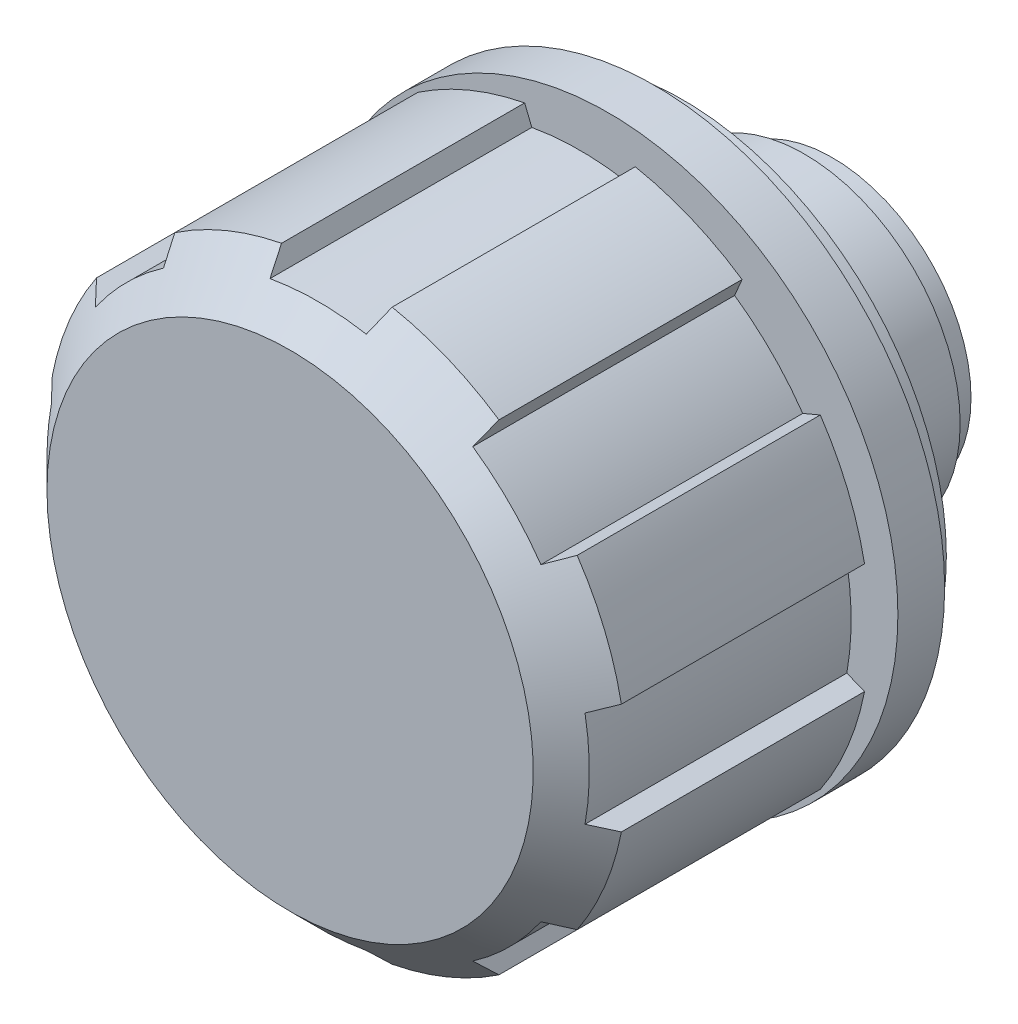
ISO-10303-21;
HEADER;
FILE_DESCRIPTION(('STEP AP214'),'2;1');
FILE_NAME('part.step','',(''),(''),'','','');
FILE_SCHEMA(('AUTOMOTIVE_DESIGN { 1 0 10303 214 1 1 1 1 }'));
ENDSEC;
DATA;
#1=APPLICATION_CONTEXT('core data for automotive mechanical design processes');
#2=APPLICATION_PROTOCOL_DEFINITION('international standard','automotive_design',2000,#1);
#3=PRODUCT_CONTEXT('',#1,'mechanical');
#4=PRODUCT('Part','Part','',(#3));
#5=PRODUCT_RELATED_PRODUCT_CATEGORY('part','',(#4));
#6=PRODUCT_DEFINITION_FORMATION('','',#4);
#7=PRODUCT_DEFINITION_CONTEXT('part definition',#1,'design');
#8=PRODUCT_DEFINITION('design','',#6,#7);
#9=PRODUCT_DEFINITION_SHAPE('','',#8);
#10=(LENGTH_UNIT() NAMED_UNIT(*) SI_UNIT(.MILLI.,.METRE.));
#11=(NAMED_UNIT(*) PLANE_ANGLE_UNIT() SI_UNIT($,.RADIAN.));
#12=(NAMED_UNIT(*) SI_UNIT($,.STERADIAN.) SOLID_ANGLE_UNIT());
#13=UNCERTAINTY_MEASURE_WITH_UNIT(LENGTH_MEASURE(1.E-05),#10,'distance_accuracy_value','');
#14=(GEOMETRIC_REPRESENTATION_CONTEXT(3) GLOBAL_UNCERTAINTY_ASSIGNED_CONTEXT((#13)) GLOBAL_UNIT_ASSIGNED_CONTEXT((#10,
#11,#12)) REPRESENTATION_CONTEXT('',''));
#15=CARTESIAN_POINT('',(0.,0.,0.));
#16=DIRECTION('',(0.,0.,1.));
#17=DIRECTION('',(1.,0.,0.));
#18=AXIS2_PLACEMENT_3D('',#15,#16,#17);
#19=CARTESIAN_POINT('',(0.,6.5,21.));
#20=DIRECTION('',(0.,0.,1.));
#21=DIRECTION('',(1.,0.,0.));
#22=AXIS2_PLACEMENT_3D('',#19,#20,#21);
#23=PLANE('',#22);
#24=CARTESIAN_POINT('',(0.,0.,21.));
#25=DIRECTION('',(0.,0.,-1.));
#26=DIRECTION('',(-1.,0.,0.));
#27=AXIS2_PLACEMENT_3D('',#24,#25,#26);
#28=CIRCLE('',#27,13.);
#29=CARTESIAN_POINT('',(-13.,0.,21.));
#30=VERTEX_POINT('',#29);
#31=EDGE_CURVE('E656',#30,#30,#28,.T.);
#32=ORIENTED_EDGE('',*,*,#31,.F.);
#33=EDGE_LOOP('',(#32));
#34=FACE_BOUND('',#33,.T.);
#35=ADVANCED_FACE('F14',(#34),#23,.T.);
#36=CARTESIAN_POINT('',(-8.26892569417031,11.9111237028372,21.5));
#37=DIRECTION('',(0.92050485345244,0.390731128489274,0.));
#38=DIRECTION('',(-0.390731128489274,0.92050485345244,0.));
#39=AXIS2_PLACEMENT_3D('',#36,#37,#38);
#40=PLANE('',#39);
#41=DIRECTION('',(0.,0.,1.));
#42=VECTOR('',#41,1.);
#43=CARTESIAN_POINT('',(-8.66749000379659,12.8500823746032,21.5));
#44=LINE('',#43,#42);
#45=CARTESIAN_POINT('',(-8.66749000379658,12.8500823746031,5.5));
#46=VERTEX_POINT('',#45);
#47=CARTESIAN_POINT('',(-8.66749000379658,12.8500823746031,18.5));
#48=VERTEX_POINT('',#47);
#49=EDGE_CURVE('E731',#46,#48,#44,.T.);
#50=ORIENTED_EDGE('',*,*,#49,.F.);
#51=DIRECTION('',(-0.390731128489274,0.92050485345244,0.));
#52=VECTOR('',#51,1.);
#53=CARTESIAN_POINT('',(-8.26892569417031,11.9111237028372,5.5));
#54=LINE('',#53,#52);
#55=CARTESIAN_POINT('',(-8.26892569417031,11.9111237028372,5.5));
#56=VERTEX_POINT('',#55);
#57=EDGE_CURVE('E308',#56,#46,#54,.T.);
#58=ORIENTED_EDGE('',*,*,#57,.F.);
#59=DIRECTION('',(0.,0.,1.));
#60=VECTOR('',#59,1.);
#61=CARTESIAN_POINT('',(-8.26892569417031,11.9111237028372,21.5));
#62=LINE('',#61,#60);
#63=CARTESIAN_POINT('',(-8.26892569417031,11.9111237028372,19.5));
#64=VERTEX_POINT('',#63);
#65=EDGE_CURVE('E322',#64,#56,#62,.F.);
#66=ORIENTED_EDGE('',*,*,#65,.F.);
#67=CARTESIAN_POINT('',(-8.66749000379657,12.8500823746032,18.5));
#68=CARTESIAN_POINT('',(-8.60110656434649,12.6936927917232,18.6667813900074));
#69=CARTESIAN_POINT('',(-8.53470115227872,12.5372514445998,18.8335054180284));
#70=CARTESIAN_POINT('',(-8.40184638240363,12.2242652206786,19.1668387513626));
#71=CARTESIAN_POINT('',(-8.33539702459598,12.06772034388,19.3334480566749));
#72=CARTESIAN_POINT('',(-8.26892569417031,11.9111237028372,19.5));
#73=B_SPLINE_CURVE_WITH_KNOTS('',3,(#67,#68,#69,#70,#71,#72),.UNSPECIFIED.,.F.,.F.,(4,2,4),(0.,
0.714229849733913,1.42845970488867),.UNSPECIFIED.);
#74=EDGE_CURVE('E396',#48,#64,#73,.T.);
#75=ORIENTED_EDGE('',*,*,#74,.F.);
#76=EDGE_LOOP('',(#50,#58,#66,#75));
#77=FACE_BOUND('',#76,.T.);
#78=ADVANCED_FACE('F515',(#77),#40,.F.);
#79=CARTESIAN_POINT('',(-2.95753942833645,15.2152213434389,21.5));
#80=DIRECTION('',(-0.927183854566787,-0.374606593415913,0.));
#81=DIRECTION('',(0.374606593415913,-0.927183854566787,0.));
#82=AXIS2_PLACEMENT_3D('',#79,#80,#81);
#83=PLANE('',#82);
#84=DIRECTION('',(0.,0.,1.));
#85=VECTOR('',#84,1.);
#86=CARTESIAN_POINT('',(-2.5754229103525,14.2694497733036,21.5));
#87=LINE('',#86,#85);
#88=CARTESIAN_POINT('',(-2.5754229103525,14.2694497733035,5.5));
#89=VERTEX_POINT('',#88);
#90=CARTESIAN_POINT('',(-2.5754229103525,14.2694497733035,19.5));
#91=VERTEX_POINT('',#90);
#92=EDGE_CURVE('E310',#89,#91,#87,.T.);
#93=ORIENTED_EDGE('',*,*,#92,.F.);
#94=DIRECTION('',(0.374606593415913,-0.927183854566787,0.));
#95=VECTOR('',#94,1.);
#96=CARTESIAN_POINT('',(-2.95753942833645,15.2152213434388,5.5));
#97=LINE('',#96,#95);
#98=CARTESIAN_POINT('',(-2.95753942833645,15.2152213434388,5.5));
#99=VERTEX_POINT('',#98);
#100=EDGE_CURVE('E301',#99,#89,#97,.T.);
#101=ORIENTED_EDGE('',*,*,#100,.F.);
#102=DIRECTION('',(0.,0.,1.));
#103=VECTOR('',#102,1.);
#104=CARTESIAN_POINT('',(-2.95753942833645,15.2152213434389,21.5));
#105=LINE('',#104,#103);
#106=CARTESIAN_POINT('',(-2.95753942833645,15.2152213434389,18.5));
#107=VERTEX_POINT('',#106);
#108=EDGE_CURVE('E318',#107,#99,#105,.F.);
#109=ORIENTED_EDGE('',*,*,#108,.F.);
#110=CARTESIAN_POINT('',(-2.57542291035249,14.2694497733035,19.5));
#111=CARTESIAN_POINT('',(-2.63915112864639,14.4271826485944,19.3334480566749));
#112=CARTESIAN_POINT('',(-2.70285828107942,14.58486338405,19.1668387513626));
#113=CARTESIAN_POINT('',(-2.83023045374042,14.9001205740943,18.8335054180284));
#114=CARTESIAN_POINT('',(-2.8938954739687,15.0576970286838,18.6667813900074));
#115=CARTESIAN_POINT('',(-2.95753942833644,15.2152213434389,18.5));
#116=B_SPLINE_CURVE_WITH_KNOTS('',3,(#110,#111,#112,#113,#114,#115),.UNSPECIFIED.,.F.,.F.,(4,2,
4),(0.,0.714229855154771,1.4284597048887),.UNSPECIFIED.);
#117=EDGE_CURVE('E498',#91,#107,#116,.T.);
#118=ORIENTED_EDGE('',*,*,#117,.F.);
#119=EDGE_LOOP('',(#93,#101,#109,#118));
#120=FACE_BOUND('',#119,.T.);
#121=ADVANCED_FACE('F511',(#120),#83,.F.);
#122=CARTESIAN_POINT('',(2.5754229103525,14.2694497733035,21.5));
#123=DIRECTION('',(0.927183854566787,-0.374606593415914,0.));
#124=DIRECTION('',(0.374606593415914,0.927183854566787,0.));
#125=AXIS2_PLACEMENT_3D('',#122,#123,#124);
#126=PLANE('',#125);
#127=DIRECTION('',(0.,0.,1.));
#128=VECTOR('',#127,1.);
#129=CARTESIAN_POINT('',(2.95753942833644,15.2152213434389,21.5));
#130=LINE('',#129,#128);
#131=CARTESIAN_POINT('',(2.95753942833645,15.2152213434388,5.5));
#132=VERTEX_POINT('',#131);
#133=CARTESIAN_POINT('',(2.95753942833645,15.2152213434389,18.5));
#134=VERTEX_POINT('',#133);
#135=EDGE_CURVE('E299',#132,#134,#130,.T.);
#136=ORIENTED_EDGE('',*,*,#135,.F.);
#137=DIRECTION('',(0.374606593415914,0.927183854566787,0.));
#138=VECTOR('',#137,1.);
#139=CARTESIAN_POINT('',(2.5754229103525,14.2694497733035,5.5));
#140=LINE('',#139,#138);
#141=CARTESIAN_POINT('',(2.5754229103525,14.2694497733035,5.5));
#142=VERTEX_POINT('',#141);
#143=EDGE_CURVE('E294',#142,#132,#140,.T.);
#144=ORIENTED_EDGE('',*,*,#143,.F.);
#145=DIRECTION('',(0.,0.,1.));
#146=VECTOR('',#145,1.);
#147=CARTESIAN_POINT('',(2.5754229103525,14.2694497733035,21.5));
#148=LINE('',#147,#146);
#149=CARTESIAN_POINT('',(2.5754229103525,14.2694497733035,19.5));
#150=VERTEX_POINT('',#149);
#151=EDGE_CURVE('E728',#150,#142,#148,.F.);
#152=ORIENTED_EDGE('',*,*,#151,.F.);
#153=CARTESIAN_POINT('',(2.95753942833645,15.2152213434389,18.5));
#154=CARTESIAN_POINT('',(2.89389547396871,15.0576970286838,18.6667813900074));
#155=CARTESIAN_POINT('',(2.83023045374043,14.9001205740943,18.8335054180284));
#156=CARTESIAN_POINT('',(2.70285828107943,14.58486338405,19.1668387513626));
#157=CARTESIAN_POINT('',(2.63915112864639,14.4271826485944,19.3334480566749));
#158=CARTESIAN_POINT('',(2.5754229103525,14.2694497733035,19.5));
#159=B_SPLINE_CURVE_WITH_KNOTS('',3,(#153,#154,#155,#156,#157,#158),.UNSPECIFIED.,.F.,.F.,(4,2,
4),(0.,0.714229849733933,1.4284597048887),.UNSPECIFIED.);
#160=EDGE_CURVE('E407',#134,#150,#159,.T.);
#161=ORIENTED_EDGE('',*,*,#160,.F.);
#162=EDGE_LOOP('',(#136,#144,#152,#161));
#163=FACE_BOUND('',#162,.T.);
#164=ADVANCED_FACE('F514',(#163),#126,.F.);
#165=CARTESIAN_POINT('',(8.66749000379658,12.8500823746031,21.5));
#166=DIRECTION('',(-0.92050485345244,0.390731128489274,0.));
#167=DIRECTION('',(-0.390731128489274,-0.92050485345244,0.));
#168=AXIS2_PLACEMENT_3D('',#165,#166,#167);
#169=PLANE('',#168);
#170=DIRECTION('',(0.,0.,1.));
#171=VECTOR('',#170,1.);
#172=CARTESIAN_POINT('',(8.26892569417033,11.9111237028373,21.5));
#173=LINE('',#172,#171);
#174=CARTESIAN_POINT('',(8.26892569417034,11.9111237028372,5.5));
#175=VERTEX_POINT('',#174);
#176=CARTESIAN_POINT('',(8.26892569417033,11.9111237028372,19.5));
#177=VERTEX_POINT('',#176);
#178=EDGE_CURVE('E292',#175,#177,#173,.T.);
#179=ORIENTED_EDGE('',*,*,#178,.F.);
#180=DIRECTION('',(-0.390731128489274,-0.92050485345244,0.));
#181=VECTOR('',#180,1.);
#182=CARTESIAN_POINT('',(8.66749000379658,12.8500823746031,5.5));
#183=LINE('',#182,#181);
#184=CARTESIAN_POINT('',(8.6674900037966,12.8500823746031,5.5));
#185=VERTEX_POINT('',#184);
#186=EDGE_CURVE('E287',#185,#175,#183,.T.);
#187=ORIENTED_EDGE('',*,*,#186,.F.);
#188=DIRECTION('',(0.,0.,1.));
#189=VECTOR('',#188,1.);
#190=CARTESIAN_POINT('',(8.6674900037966,12.8500823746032,21.5));
#191=LINE('',#190,#189);
#192=CARTESIAN_POINT('',(8.6674900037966,12.8500823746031,18.5));
#193=VERTEX_POINT('',#192);
#194=EDGE_CURVE('E305',#193,#185,#191,.F.);
#195=ORIENTED_EDGE('',*,*,#194,.F.);
#196=CARTESIAN_POINT('',(8.26892569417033,11.9111237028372,19.5));
#197=CARTESIAN_POINT('',(8.335397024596,12.06772034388,19.3334480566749));
#198=CARTESIAN_POINT('',(8.40184638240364,12.2242652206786,19.1668387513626));
#199=CARTESIAN_POINT('',(8.53470115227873,12.5372514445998,18.8335054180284));
#200=CARTESIAN_POINT('',(8.6011065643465,12.6936927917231,18.6667813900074));
#201=CARTESIAN_POINT('',(8.66749000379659,12.8500823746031,18.5));
#202=B_SPLINE_CURVE_WITH_KNOTS('',3,(#196,#197,#198,#199,#200,#201),.UNSPECIFIED.,.F.,.F.,(4,2,
4),(0.,0.714229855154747,1.42845970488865),.UNSPECIFIED.);
#203=EDGE_CURVE('E415',#177,#193,#202,.T.);
#204=ORIENTED_EDGE('',*,*,#203,.F.);
#205=EDGE_LOOP('',(#179,#187,#195,#204));
#206=FACE_BOUND('',#205,.T.);
#207=ADVANCED_FACE('F745',(#206),#169,.F.);
#208=CARTESIAN_POINT('',(11.9111237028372,8.26892569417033,21.5));
#209=DIRECTION('',(0.390731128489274,-0.92050485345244,0.));
#210=DIRECTION('',(0.92050485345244,0.390731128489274,0.));
#211=AXIS2_PLACEMENT_3D('',#208,#209,#210);
#212=PLANE('',#211);
#213=DIRECTION('',(0.,0.,1.));
#214=VECTOR('',#213,1.);
#215=CARTESIAN_POINT('',(12.8500823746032,8.6674900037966,21.5));
#216=LINE('',#215,#214);
#217=CARTESIAN_POINT('',(12.8500823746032,8.66749000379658,5.5));
#218=VERTEX_POINT('',#217);
#219=CARTESIAN_POINT('',(12.8500823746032,8.6674900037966,18.5));
#220=VERTEX_POINT('',#219);
#221=EDGE_CURVE('E285',#218,#220,#216,.T.);
#222=ORIENTED_EDGE('',*,*,#221,.F.);
#223=DIRECTION('',(0.92050485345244,0.390731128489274,0.));
#224=VECTOR('',#223,1.);
#225=CARTESIAN_POINT('',(11.9111237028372,8.26892569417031,5.5));
#226=LINE('',#225,#224);
#227=CARTESIAN_POINT('',(11.9111237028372,8.26892569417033,5.5));
#228=VERTEX_POINT('',#227);
#229=EDGE_CURVE('E280',#228,#218,#226,.T.);
#230=ORIENTED_EDGE('',*,*,#229,.F.);
#231=DIRECTION('',(0.,0.,1.));
#232=VECTOR('',#231,1.);
#233=CARTESIAN_POINT('',(11.9111237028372,8.26892569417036,21.5));
#234=LINE('',#233,#232);
#235=CARTESIAN_POINT('',(11.9111237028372,8.26892569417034,19.5));
#236=VERTEX_POINT('',#235);
#237=EDGE_CURVE('E298',#236,#228,#234,.F.);
#238=ORIENTED_EDGE('',*,*,#237,.F.);
#239=CARTESIAN_POINT('',(12.8500823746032,8.6674900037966,18.5));
#240=CARTESIAN_POINT('',(12.6936927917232,8.60110656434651,18.6667813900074));
#241=CARTESIAN_POINT('',(12.5372514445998,8.53470115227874,18.8335054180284));
#242=CARTESIAN_POINT('',(12.2242652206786,8.40184638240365,19.1668387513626));
#243=CARTESIAN_POINT('',(12.06772034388,8.335397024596,19.3334480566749));
#244=CARTESIAN_POINT('',(11.9111237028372,8.26892569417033,19.5));
#245=B_SPLINE_CURVE_WITH_KNOTS('',3,(#239,#240,#241,#242,#243,#244),.UNSPECIFIED.,.F.,.F.,(4,2,
4),(0.,0.714229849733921,1.42845970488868),.UNSPECIFIED.);
#246=EDGE_CURVE('E423',#220,#236,#245,.T.);
#247=ORIENTED_EDGE('',*,*,#246,.F.);
#248=EDGE_LOOP('',(#222,#230,#238,#247));
#249=FACE_BOUND('',#248,.T.);
#250=ADVANCED_FACE('F751',(#249),#212,.F.);
#251=CARTESIAN_POINT('',(15.2152213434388,2.95753942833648,21.5));
#252=DIRECTION('',(-0.374606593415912,0.927183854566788,0.));
#253=DIRECTION('',(-0.927183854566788,-0.374606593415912,0.));
#254=AXIS2_PLACEMENT_3D('',#251,#252,#253);
#255=PLANE('',#254);
#256=DIRECTION('',(0.,0.,1.));
#257=VECTOR('',#256,1.);
#258=CARTESIAN_POINT('',(14.2694497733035,2.57542291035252,21.5));
#259=LINE('',#258,#257);
#260=CARTESIAN_POINT('',(14.2694497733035,2.57542291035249,5.5));
#261=VERTEX_POINT('',#260);
#262=CARTESIAN_POINT('',(14.2694497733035,2.57542291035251,19.5));
#263=VERTEX_POINT('',#262);
#264=EDGE_CURVE('E278',#261,#263,#259,.T.);
#265=ORIENTED_EDGE('',*,*,#264,.F.);
#266=DIRECTION('',(-0.927183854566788,-0.374606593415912,0.));
#267=VECTOR('',#266,1.);
#268=CARTESIAN_POINT('',(15.2152213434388,2.95753942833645,5.5));
#269=LINE('',#268,#267);
#270=CARTESIAN_POINT('',(15.2152213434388,2.95753942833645,5.5));
#271=VERTEX_POINT('',#270);
#272=EDGE_CURVE('E273',#271,#261,#269,.T.);
#273=ORIENTED_EDGE('',*,*,#272,.F.);
#274=DIRECTION('',(0.,0.,1.));
#275=VECTOR('',#274,1.);
#276=CARTESIAN_POINT('',(15.2152213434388,2.95753942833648,21.5));
#277=LINE('',#276,#275);
#278=CARTESIAN_POINT('',(15.2152213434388,2.95753942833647,18.5));
#279=VERTEX_POINT('',#278);
#280=EDGE_CURVE('E291',#279,#271,#277,.F.);
#281=ORIENTED_EDGE('',*,*,#280,.F.);
#282=CARTESIAN_POINT('',(14.2694497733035,2.57542291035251,19.5));
#283=CARTESIAN_POINT('',(14.4271826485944,2.63915112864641,19.3334480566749));
#284=CARTESIAN_POINT('',(14.58486338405,2.70285828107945,19.1668387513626));
#285=CARTESIAN_POINT('',(14.9001205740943,2.83023045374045,18.8335054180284));
#286=CARTESIAN_POINT('',(15.0576970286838,2.89389547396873,18.6667813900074));
#287=CARTESIAN_POINT('',(15.2152213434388,2.95753942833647,18.5));
#288=B_SPLINE_CURVE_WITH_KNOTS('',3,(#282,#283,#284,#285,#286,#287),.UNSPECIFIED.,.F.,.F.,(4,2,
4),(0.,0.714229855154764,1.42845970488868),.UNSPECIFIED.);
#289=EDGE_CURVE('E431',#263,#279,#288,.T.);
#290=ORIENTED_EDGE('',*,*,#289,.F.);
#291=EDGE_LOOP('',(#265,#273,#281,#290));
#292=FACE_BOUND('',#291,.T.);
#293=ADVANCED_FACE('F755',(#292),#255,.F.);
#294=CARTESIAN_POINT('',(14.2694497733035,-2.57542291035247,21.5));
#295=DIRECTION('',(-0.374606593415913,-0.927183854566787,0.));
#296=DIRECTION('',(0.927183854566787,-0.374606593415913,0.));
#297=AXIS2_PLACEMENT_3D('',#294,#295,#296);
#298=PLANE('',#297);
#299=DIRECTION('',(0.,0.,1.));
#300=VECTOR('',#299,1.);
#301=CARTESIAN_POINT('',(15.2152213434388,-2.95753942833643,21.5));
#302=LINE('',#301,#300);
#303=CARTESIAN_POINT('',(15.2152213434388,-2.95753942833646,5.5));
#304=VERTEX_POINT('',#303);
#305=CARTESIAN_POINT('',(15.2152213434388,-2.95753942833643,18.5));
#306=VERTEX_POINT('',#305);
#307=EDGE_CURVE('E271',#304,#306,#302,.T.);
#308=ORIENTED_EDGE('',*,*,#307,.F.);
#309=DIRECTION('',(0.927183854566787,-0.374606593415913,0.));
#310=VECTOR('',#309,1.);
#311=CARTESIAN_POINT('',(14.2694497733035,-2.5754229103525,5.5));
#312=LINE('',#311,#310);
#313=CARTESIAN_POINT('',(14.2694497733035,-2.57542291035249,5.5));
#314=VERTEX_POINT('',#313);
#315=EDGE_CURVE('E266',#314,#304,#312,.T.);
#316=ORIENTED_EDGE('',*,*,#315,.F.);
#317=DIRECTION('',(0.,0.,1.));
#318=VECTOR('',#317,1.);
#319=CARTESIAN_POINT('',(14.2694497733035,-2.57542291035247,21.5));
#320=LINE('',#319,#318);
#321=CARTESIAN_POINT('',(14.2694497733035,-2.57542291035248,19.5));
#322=VERTEX_POINT('',#321);
#323=EDGE_CURVE('E284',#322,#314,#320,.F.);
#324=ORIENTED_EDGE('',*,*,#323,.F.);
#325=CARTESIAN_POINT('',(15.2152213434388,-2.95753942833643,18.5));
#326=CARTESIAN_POINT('',(15.0576970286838,-2.89389547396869,18.6667813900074));
#327=CARTESIAN_POINT('',(14.9001205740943,-2.83023045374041,18.8335054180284));
#328=CARTESIAN_POINT('',(14.58486338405,-2.70285828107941,19.1668387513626));
#329=CARTESIAN_POINT('',(14.4271826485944,-2.63915112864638,19.3334480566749));
#330=CARTESIAN_POINT('',(14.2694497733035,-2.57542291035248,19.5));
#331=B_SPLINE_CURVE_WITH_KNOTS('',3,(#325,#326,#327,#328,#329,#330),.UNSPECIFIED.,.F.,.F.,(4,2,
4),(0.,0.714229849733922,1.42845970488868),.UNSPECIFIED.);
#332=EDGE_CURVE('E439',#306,#322,#331,.T.);
#333=ORIENTED_EDGE('',*,*,#332,.F.);
#334=EDGE_LOOP('',(#308,#316,#324,#333));
#335=FACE_BOUND('',#334,.T.);
#336=ADVANCED_FACE('F760',(#335),#298,.F.);
#337=CARTESIAN_POINT('',(12.8500823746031,-8.66749000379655,21.5));
#338=DIRECTION('',(0.390731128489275,0.92050485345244,0.));
#339=DIRECTION('',(-0.92050485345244,0.390731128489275,0.));
#340=AXIS2_PLACEMENT_3D('',#337,#338,#339);
#341=PLANE('',#340);
#342=DIRECTION('',(0.,0.,1.));
#343=VECTOR('',#342,1.);
#344=CARTESIAN_POINT('',(11.9111237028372,-8.26892569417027,21.5));
#345=LINE('',#344,#343);
#346=CARTESIAN_POINT('',(11.9111237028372,-8.26892569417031,5.5));
#347=VERTEX_POINT('',#346);
#348=CARTESIAN_POINT('',(11.9111237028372,-8.26892569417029,19.5));
#349=VERTEX_POINT('',#348);
#350=EDGE_CURVE('E264',#347,#349,#345,.T.);
#351=ORIENTED_EDGE('',*,*,#350,.F.);
#352=DIRECTION('',(-0.92050485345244,0.390731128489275,0.));
#353=VECTOR('',#352,1.);
#354=CARTESIAN_POINT('',(12.8500823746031,-8.66749000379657,5.5));
#355=LINE('',#354,#353);
#356=CARTESIAN_POINT('',(12.8500823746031,-8.6674900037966,5.5));
#357=VERTEX_POINT('',#356);
#358=EDGE_CURVE('E261',#357,#347,#355,.T.);
#359=ORIENTED_EDGE('',*,*,#358,.F.);
#360=DIRECTION('',(0.,0.,1.));
#361=VECTOR('',#360,1.);
#362=CARTESIAN_POINT('',(12.8500823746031,-8.66749000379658,21.5));
#363=LINE('',#362,#361);
#364=CARTESIAN_POINT('',(12.8500823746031,-8.66749000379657,18.5));
#365=VERTEX_POINT('',#364);
#366=EDGE_CURVE('E277',#365,#357,#363,.F.);
#367=ORIENTED_EDGE('',*,*,#366,.F.);
#368=CARTESIAN_POINT('',(11.9111237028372,-8.2689256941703,19.5));
#369=CARTESIAN_POINT('',(12.06772034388,-8.33539702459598,19.3334480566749));
#370=CARTESIAN_POINT('',(12.2242652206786,-8.40184638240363,19.1668387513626));
#371=CARTESIAN_POINT('',(12.5372514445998,-8.53470115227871,18.8335054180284));
#372=CARTESIAN_POINT('',(12.6936927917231,-8.60110656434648,18.6667813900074));
#373=CARTESIAN_POINT('',(12.8500823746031,-8.66749000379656,18.5));
#374=B_SPLINE_CURVE_WITH_KNOTS('',3,(#368,#369,#370,#371,#372,#373),.UNSPECIFIED.,.F.,.F.,(4,2,
4),(0.,0.714229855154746,1.42845970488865),.UNSPECIFIED.);
#375=EDGE_CURVE('E447',#349,#365,#374,.T.);
#376=ORIENTED_EDGE('',*,*,#375,.F.);
#377=EDGE_LOOP('',(#351,#359,#367,#376));
#378=FACE_BOUND('',#377,.T.);
#379=ADVANCED_FACE('F764',(#378),#341,.F.);
#380=CARTESIAN_POINT('',(8.2689256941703,-11.9111237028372,21.5));
#381=DIRECTION('',(-0.92050485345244,-0.390731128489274,0.));
#382=DIRECTION('',(0.390731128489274,-0.92050485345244,0.));
#383=AXIS2_PLACEMENT_3D('',#380,#381,#382);
#384=PLANE('',#383);
#385=DIRECTION('',(0.,0.,1.));
#386=VECTOR('',#385,1.);
#387=CARTESIAN_POINT('',(8.66749000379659,-12.8500823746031,21.5));
#388=LINE('',#387,#386);
#389=CARTESIAN_POINT('',(8.66749000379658,-12.8500823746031,5.5));
#390=VERTEX_POINT('',#389);
#391=CARTESIAN_POINT('',(8.66749000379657,-12.8500823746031,18.5));
#392=VERTEX_POINT('',#391);
#393=EDGE_CURVE('E705',#390,#392,#388,.T.);
#394=ORIENTED_EDGE('',*,*,#393,.F.);
#395=DIRECTION('',(0.390731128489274,-0.92050485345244,0.));
#396=VECTOR('',#395,1.);
#397=CARTESIAN_POINT('',(8.2689256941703,-11.9111237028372,5.5));
#398=LINE('',#397,#396);
#399=CARTESIAN_POINT('',(8.26892569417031,-11.9111237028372,5.5));
#400=VERTEX_POINT('',#399);
#401=EDGE_CURVE('E259',#400,#390,#398,.T.);
#402=ORIENTED_EDGE('',*,*,#401,.F.);
#403=DIRECTION('',(0.,0.,1.));
#404=VECTOR('',#403,1.);
#405=CARTESIAN_POINT('',(8.26892569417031,-11.9111237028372,21.5));
#406=LINE('',#405,#404);
#407=CARTESIAN_POINT('',(8.2689256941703,-11.9111237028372,19.5));
#408=VERTEX_POINT('',#407);
#409=EDGE_CURVE('E270',#408,#400,#406,.F.);
#410=ORIENTED_EDGE('',*,*,#409,.F.);
#411=CARTESIAN_POINT('',(8.66749000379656,-12.8500823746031,18.5));
#412=CARTESIAN_POINT('',(8.60110656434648,-12.6936927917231,18.6667813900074));
#413=CARTESIAN_POINT('',(8.53470115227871,-12.5372514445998,18.8335054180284));
#414=CARTESIAN_POINT('',(8.40184638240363,-12.2242652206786,19.1668387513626));
#415=CARTESIAN_POINT('',(8.33539702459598,-12.0677203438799,19.333448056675));
#416=CARTESIAN_POINT('',(8.2689256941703,-11.9111237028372,19.5));
#417=B_SPLINE_CURVE_WITH_KNOTS('',3,(#411,#412,#413,#414,#415,#416),.UNSPECIFIED.,.F.,.F.,(4,2,
4),(0.,0.714229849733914,1.42845970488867),.UNSPECIFIED.);
#418=EDGE_CURVE('E241',#392,#408,#417,.T.);
#419=ORIENTED_EDGE('',*,*,#418,.F.);
#420=EDGE_LOOP('',(#394,#402,#410,#419));
#421=FACE_BOUND('',#420,.T.);
#422=ADVANCED_FACE('F701',(#421),#384,.F.);
#423=CARTESIAN_POINT('',(2.95753942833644,-15.2152213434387,21.5));
#424=DIRECTION('',(0.927183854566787,0.374606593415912,0.));
#425=DIRECTION('',(-0.374606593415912,0.927183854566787,0.));
#426=AXIS2_PLACEMENT_3D('',#423,#424,#425);
#427=PLANE('',#426);
#428=DIRECTION('',(0.,0.,1.));
#429=VECTOR('',#428,1.);
#430=CARTESIAN_POINT('',(2.57542291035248,-14.2694497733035,21.5));
#431=LINE('',#430,#429);
#432=CARTESIAN_POINT('',(2.57542291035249,-14.2694497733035,5.5));
#433=VERTEX_POINT('',#432);
#434=CARTESIAN_POINT('',(2.57542291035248,-14.2694497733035,19.5));
#435=VERTEX_POINT('',#434);
#436=EDGE_CURVE('E220',#433,#435,#431,.T.);
#437=ORIENTED_EDGE('',*,*,#436,.F.);
#438=DIRECTION('',(-0.374606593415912,0.927183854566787,0.));
#439=VECTOR('',#438,1.);
#440=CARTESIAN_POINT('',(2.95753942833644,-15.2152213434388,5.5));
#441=LINE('',#440,#439);
#442=CARTESIAN_POINT('',(2.95753942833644,-15.2152213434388,5.5));
#443=VERTEX_POINT('',#442);
#444=EDGE_CURVE('E242',#443,#433,#441,.T.);
#445=ORIENTED_EDGE('',*,*,#444,.F.);
#446=DIRECTION('',(0.,0.,1.));
#447=VECTOR('',#446,1.);
#448=CARTESIAN_POINT('',(2.95753942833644,-15.2152213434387,21.5));
#449=LINE('',#448,#447);
#450=CARTESIAN_POINT('',(2.95753942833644,-15.2152213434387,18.5));
#451=VERTEX_POINT('',#450);
#452=EDGE_CURVE('E237',#451,#443,#449,.F.);
#453=ORIENTED_EDGE('',*,*,#452,.F.);
#454=CARTESIAN_POINT('',(2.57542291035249,-14.2694497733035,19.5));
#455=CARTESIAN_POINT('',(2.63915112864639,-14.4271826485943,19.333448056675));
#456=CARTESIAN_POINT('',(2.70285828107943,-14.5848633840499,19.1668387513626));
#457=CARTESIAN_POINT('',(2.83023045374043,-14.9001205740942,18.8335054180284));
#458=CARTESIAN_POINT('',(2.8938954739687,-15.0576970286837,18.6667813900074));
#459=CARTESIAN_POINT('',(2.95753942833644,-15.2152213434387,18.5));
#460=B_SPLINE_CURVE_WITH_KNOTS('',3,(#454,#455,#456,#457,#458,#459),.UNSPECIFIED.,.F.,.F.,(4,2,
4),(0.,0.714229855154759,1.42845970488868),.UNSPECIFIED.);
#461=EDGE_CURVE('E234',#435,#451,#460,.T.);
#462=ORIENTED_EDGE('',*,*,#461,.F.);
#463=EDGE_LOOP('',(#437,#445,#453,#462));
#464=FACE_BOUND('',#463,.T.);
#465=ADVANCED_FACE('F235',(#464),#427,.F.);
#466=CARTESIAN_POINT('',(-2.5754229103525,-14.2694497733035,21.5));
#467=DIRECTION('',(-0.927183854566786,0.374606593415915,0.));
#468=DIRECTION('',(-0.374606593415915,-0.927183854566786,0.));
#469=AXIS2_PLACEMENT_3D('',#466,#467,#468);
#470=PLANE('',#469);
#471=DIRECTION('',(0.,0.,1.));
#472=VECTOR('',#471,1.);
#473=CARTESIAN_POINT('',(-2.95753942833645,-15.2152213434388,21.5));
#474=LINE('',#473,#472);
#475=CARTESIAN_POINT('',(-2.95753942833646,-15.2152213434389,5.5));
#476=VERTEX_POINT('',#475);
#477=CARTESIAN_POINT('',(-2.95753942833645,-15.2152213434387,18.5));
#478=VERTEX_POINT('',#477);
#479=EDGE_CURVE('E684',#476,#478,#474,.T.);
#480=ORIENTED_EDGE('',*,*,#479,.F.);
#481=DIRECTION('',(-0.374606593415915,-0.927183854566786,0.));
#482=VECTOR('',#481,1.);
#483=CARTESIAN_POINT('',(-2.5754229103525,-14.2694497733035,5.5));
#484=LINE('',#483,#482);
#485=CARTESIAN_POINT('',(-2.57542291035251,-14.2694497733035,5.5));
#486=VERTEX_POINT('',#485);
#487=EDGE_CURVE('E679',#486,#476,#484,.T.);
#488=ORIENTED_EDGE('',*,*,#487,.F.);
#489=DIRECTION('',(0.,0.,1.));
#490=VECTOR('',#489,1.);
#491=CARTESIAN_POINT('',(-2.57542291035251,-14.2694497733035,21.5));
#492=LINE('',#491,#490);
#493=CARTESIAN_POINT('',(-2.5754229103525,-14.2694497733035,19.5));
#494=VERTEX_POINT('',#493);
#495=EDGE_CURVE('E230',#494,#486,#492,.F.);
#496=ORIENTED_EDGE('',*,*,#495,.F.);
#497=CARTESIAN_POINT('',(-2.95753942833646,-15.2152213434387,18.5));
#498=CARTESIAN_POINT('',(-2.89389547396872,-15.0576970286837,18.6667813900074));
#499=CARTESIAN_POINT('',(-2.83023045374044,-14.9001205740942,18.8335054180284));
#500=CARTESIAN_POINT('',(-2.70285828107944,-14.5848633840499,19.1668387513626));
#501=CARTESIAN_POINT('',(-2.6391511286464,-14.4271826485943,19.333448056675));
#502=CARTESIAN_POINT('',(-2.5754229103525,-14.2694497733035,19.5));
#503=B_SPLINE_CURVE_WITH_KNOTS('',3,(#497,#498,#499,#500,#501,#502),.UNSPECIFIED.,.F.,.F.,(4,2,
4),(0.,0.714229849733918,1.42845970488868),.UNSPECIFIED.);
#504=EDGE_CURVE('E248',#478,#494,#503,.T.);
#505=ORIENTED_EDGE('',*,*,#504,.F.);
#506=EDGE_LOOP('',(#480,#488,#496,#505));
#507=FACE_BOUND('',#506,.T.);
#508=ADVANCED_FACE('F1016',(#507),#470,.F.);
#509=CARTESIAN_POINT('',(-8.66749000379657,-12.8500823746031,21.5));
#510=DIRECTION('',(0.920504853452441,-0.390731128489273,0.));
#511=DIRECTION('',(0.390731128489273,0.920504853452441,0.));
#512=AXIS2_PLACEMENT_3D('',#509,#510,#511);
#513=PLANE('',#512);
#514=DIRECTION('',(0.,0.,1.));
#515=VECTOR('',#514,1.);
#516=CARTESIAN_POINT('',(-8.26892569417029,-11.9111237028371,21.5));
#517=LINE('',#516,#515);
#518=CARTESIAN_POINT('',(-8.2689256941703,-11.9111237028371,5.5));
#519=VERTEX_POINT('',#518);
#520=CARTESIAN_POINT('',(-8.2689256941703,-11.9111237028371,19.5));
#521=VERTEX_POINT('',#520);
#522=EDGE_CURVE('E677',#519,#521,#517,.T.);
#523=ORIENTED_EDGE('',*,*,#522,.F.);
#524=DIRECTION('',(0.390731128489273,0.920504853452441,0.));
#525=VECTOR('',#524,1.);
#526=CARTESIAN_POINT('',(-8.66749000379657,-12.8500823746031,5.5));
#527=LINE('',#526,#525);
#528=CARTESIAN_POINT('',(-8.66749000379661,-12.8500823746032,5.5));
#529=VERTEX_POINT('',#528);
#530=EDGE_CURVE('E673',#529,#519,#527,.T.);
#531=ORIENTED_EDGE('',*,*,#530,.F.);
#532=DIRECTION('',(0.,0.,1.));
#533=VECTOR('',#532,1.);
#534=CARTESIAN_POINT('',(-8.66749000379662,-12.8500823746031,21.5));
#535=LINE('',#534,#533);
#536=CARTESIAN_POINT('',(-8.6674900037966,-12.8500823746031,18.5));
#537=VERTEX_POINT('',#536);
#538=EDGE_CURVE('E253',#537,#529,#535,.F.);
#539=ORIENTED_EDGE('',*,*,#538,.F.);
#540=CARTESIAN_POINT('',(-8.26892569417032,-11.9111237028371,19.5));
#541=CARTESIAN_POINT('',(-8.33539702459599,-12.0677203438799,19.333448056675));
#542=CARTESIAN_POINT('',(-8.40184638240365,-12.2242652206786,19.1668387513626));
#543=CARTESIAN_POINT('',(-8.53470115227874,-12.5372514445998,18.8335054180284));
#544=CARTESIAN_POINT('',(-8.60110656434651,-12.6936927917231,18.6667813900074));
#545=CARTESIAN_POINT('',(-8.66749000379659,-12.8500823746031,18.5));
#546=B_SPLINE_CURVE_WITH_KNOTS('',3,(#540,#541,#542,#543,#544,#545),.UNSPECIFIED.,.F.,.F.,(4,2,
4),(0.,0.714229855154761,1.42845970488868),.UNSPECIFIED.);
#547=EDGE_CURVE('E478',#521,#537,#546,.T.);
#548=ORIENTED_EDGE('',*,*,#547,.F.);
#549=EDGE_LOOP('',(#523,#531,#539,#548));
#550=FACE_BOUND('',#549,.T.);
#551=ADVANCED_FACE('F1008',(#550),#513,.F.);
#552=CARTESIAN_POINT('',(-11.9111237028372,-8.26892569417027,21.5));
#553=DIRECTION('',(-0.390731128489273,0.920504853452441,0.));
#554=DIRECTION('',(-0.920504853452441,-0.390731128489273,0.));
#555=AXIS2_PLACEMENT_3D('',#552,#553,#554);
#556=PLANE('',#555);
#557=DIRECTION('',(0.,0.,1.));
#558=VECTOR('',#557,1.);
#559=CARTESIAN_POINT('',(-12.8500823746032,-8.66749000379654,21.5));
#560=LINE('',#559,#558);
#561=CARTESIAN_POINT('',(-12.8500823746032,-8.66749000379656,5.5));
#562=VERTEX_POINT('',#561);
#563=CARTESIAN_POINT('',(-12.8500823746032,-8.66749000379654,18.5));
#564=VERTEX_POINT('',#563);
#565=EDGE_CURVE('E671',#562,#564,#560,.T.);
#566=ORIENTED_EDGE('',*,*,#565,.F.);
#567=DIRECTION('',(-0.920504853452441,-0.390731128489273,0.));
#568=VECTOR('',#567,1.);
#569=CARTESIAN_POINT('',(-11.9111237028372,-8.26892569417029,5.5));
#570=LINE('',#569,#568);
#571=CARTESIAN_POINT('',(-11.9111237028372,-8.26892569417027,5.5));
#572=VERTEX_POINT('',#571);
#573=EDGE_CURVE('E504',#572,#562,#570,.T.);
#574=ORIENTED_EDGE('',*,*,#573,.F.);
#575=DIRECTION('',(0.,0.,1.));
#576=VECTOR('',#575,1.);
#577=CARTESIAN_POINT('',(-11.9111237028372,-8.26892569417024,21.5));
#578=LINE('',#577,#576);
#579=CARTESIAN_POINT('',(-11.9111237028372,-8.26892569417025,19.5));
#580=VERTEX_POINT('',#579);
#581=EDGE_CURVE('E683',#580,#572,#578,.F.);
#582=ORIENTED_EDGE('',*,*,#581,.F.);
#583=CARTESIAN_POINT('',(-12.8500823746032,-8.66749000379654,18.5));
#584=CARTESIAN_POINT('',(-12.6936927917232,-8.60110656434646,18.6667813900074));
#585=CARTESIAN_POINT('',(-12.5372514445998,-8.53470115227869,18.8335054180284));
#586=CARTESIAN_POINT('',(-12.2242652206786,-8.4018463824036,19.1668387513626));
#587=CARTESIAN_POINT('',(-12.06772034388,-8.33539702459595,19.3334480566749));
#588=CARTESIAN_POINT('',(-11.9111237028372,-8.26892569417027,19.5));
#589=B_SPLINE_CURVE_WITH_KNOTS('',3,(#583,#584,#585,#586,#587,#588),.UNSPECIFIED.,.F.,.F.,(4,2,
4),(0.,0.714229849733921,1.42845970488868),.UNSPECIFIED.);
#590=EDGE_CURVE('E485',#564,#580,#589,.T.);
#591=ORIENTED_EDGE('',*,*,#590,.F.);
#592=EDGE_LOOP('',(#566,#574,#582,#591));
#593=FACE_BOUND('',#592,.T.);
#594=ADVANCED_FACE('F1000',(#593),#556,.F.);
#595=CARTESIAN_POINT('',(-15.2152213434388,-2.95753942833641,21.5));
#596=DIRECTION('',(0.374606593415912,-0.927183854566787,0.));
#597=DIRECTION('',(0.927183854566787,0.374606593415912,0.));
#598=AXIS2_PLACEMENT_3D('',#595,#596,#597);
#599=PLANE('',#598);
#600=DIRECTION('',(0.,0.,1.));
#601=VECTOR('',#600,1.);
#602=CARTESIAN_POINT('',(-14.2694497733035,-2.57542291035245,21.5));
#603=LINE('',#602,#601);
#604=CARTESIAN_POINT('',(-14.2694497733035,-2.57542291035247,5.5));
#605=VERTEX_POINT('',#604);
#606=CARTESIAN_POINT('',(-14.2694497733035,-2.57542291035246,19.5));
#607=VERTEX_POINT('',#606);
#608=EDGE_CURVE('E666',#605,#607,#603,.T.);
#609=ORIENTED_EDGE('',*,*,#608,.F.);
#610=DIRECTION('',(0.927183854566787,0.374606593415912,0.));
#611=VECTOR('',#610,1.);
#612=CARTESIAN_POINT('',(-15.2152213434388,-2.95753942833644,5.5));
#613=LINE('',#612,#611);
#614=CARTESIAN_POINT('',(-15.2152213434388,-2.95753942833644,5.5));
#615=VERTEX_POINT('',#614);
#616=EDGE_CURVE('E501',#615,#605,#613,.T.);
#617=ORIENTED_EDGE('',*,*,#616,.F.);
#618=DIRECTION('',(0.,0.,1.));
#619=VECTOR('',#618,1.);
#620=CARTESIAN_POINT('',(-15.2152213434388,-2.95753942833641,21.5));
#621=LINE('',#620,#619);
#622=CARTESIAN_POINT('',(-15.2152213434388,-2.95753942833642,18.5));
#623=VERTEX_POINT('',#622);
#624=EDGE_CURVE('E676',#623,#615,#621,.F.);
#625=ORIENTED_EDGE('',*,*,#624,.F.);
#626=CARTESIAN_POINT('',(-14.2694497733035,-2.57542291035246,19.5));
#627=CARTESIAN_POINT('',(-14.4271826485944,-2.63915112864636,19.3334480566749));
#628=CARTESIAN_POINT('',(-14.58486338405,-2.7028582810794,19.1668387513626));
#629=CARTESIAN_POINT('',(-14.9001205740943,-2.8302304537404,18.8335054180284));
#630=CARTESIAN_POINT('',(-15.0576970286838,-2.89389547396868,18.6667813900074));
#631=CARTESIAN_POINT('',(-15.2152213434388,-2.95753942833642,18.5));
#632=B_SPLINE_CURVE_WITH_KNOTS('',3,(#626,#627,#628,#629,#630,#631),.UNSPECIFIED.,.F.,.F.,(4,2,
4),(0.,0.714229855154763,1.42845970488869),.UNSPECIFIED.);
#633=EDGE_CURVE('E490',#607,#623,#632,.T.);
#634=ORIENTED_EDGE('',*,*,#633,.F.);
#635=EDGE_LOOP('',(#609,#617,#625,#634));
#636=FACE_BOUND('',#635,.T.);
#637=ADVANCED_FACE('F389',(#636),#599,.F.);
#638=CARTESIAN_POINT('',(0.,0.,18.5));
#639=DIRECTION('',(0.,0.,-1.));
#640=DIRECTION('',(-1.,0.,0.));
#641=AXIS2_PLACEMENT_3D('',#638,#639,#640);
#642=CONICAL_SURFACE('',#641,15.5,0.785398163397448);
#643=ORIENTED_EDGE('',*,*,#160,.T.);
#644=CARTESIAN_POINT('',(0.,0.,19.5));
#645=DIRECTION('',(0.,0.,1.));
#646=DIRECTION('',(1.,0.,0.));
#647=AXIS2_PLACEMENT_3D('',#644,#645,#646);
#648=CIRCLE('',#647,14.5);
#649=EDGE_CURVE('E306',#91,#150,#648,.F.);
#650=ORIENTED_EDGE('',*,*,#649,.F.);
#651=ORIENTED_EDGE('',*,*,#117,.T.);
#652=CARTESIAN_POINT('',(0.,0.,18.5));
#653=DIRECTION('',(0.,0.,1.));
#654=DIRECTION('',(1.,0.,0.));
#655=AXIS2_PLACEMENT_3D('',#652,#653,#654);
#656=CIRCLE('',#655,15.5);
#657=EDGE_CURVE('E315',#48,#107,#656,.F.);
#658=ORIENTED_EDGE('',*,*,#657,.F.);
#659=ORIENTED_EDGE('',*,*,#74,.T.);
#660=CARTESIAN_POINT('',(0.,0.,19.5));
#661=DIRECTION('',(0.,0.,1.));
#662=DIRECTION('',(1.,0.,0.));
#663=AXIS2_PLACEMENT_3D('',#660,#661,#662);
#664=CIRCLE('',#663,14.5);
#665=CARTESIAN_POINT('',(-11.9111237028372,8.26892569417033,19.5));
#666=VERTEX_POINT('',#665);
#667=EDGE_CURVE('E320',#666,#64,#664,.F.);
#668=ORIENTED_EDGE('',*,*,#667,.F.);
#669=CARTESIAN_POINT('',(-11.9111237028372,8.26892569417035,19.5));
#670=CARTESIAN_POINT('',(-12.06772034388,8.33539702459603,19.3334480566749));
#671=CARTESIAN_POINT('',(-12.2242652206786,8.40184638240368,19.1668387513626));
#672=CARTESIAN_POINT('',(-12.5372514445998,8.53470115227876,18.8335054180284));
#673=CARTESIAN_POINT('',(-12.6936927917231,8.60110656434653,18.6667813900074));
#674=CARTESIAN_POINT('',(-12.8500823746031,8.66749000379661,18.5));
#675=B_SPLINE_CURVE_WITH_KNOTS('',3,(#669,#670,#671,#672,#673,#674),.UNSPECIFIED.,.F.,.F.,(4,2,
4),(0.,0.714229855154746,1.42845970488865),.UNSPECIFIED.);
#676=CARTESIAN_POINT('',(-12.8500823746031,8.66749000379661,18.5));
#677=VERTEX_POINT('',#676);
#678=EDGE_CURVE('E375',#666,#677,#675,.T.);
#679=ORIENTED_EDGE('',*,*,#678,.T.);
#680=CARTESIAN_POINT('',(0.,0.,18.5));
#681=DIRECTION('',(0.,0.,1.));
#682=DIRECTION('',(1.,0.,0.));
#683=AXIS2_PLACEMENT_3D('',#680,#681,#682);
#684=CIRCLE('',#683,15.5);
#685=CARTESIAN_POINT('',(-15.2152213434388,2.95753942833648,18.5));
#686=VERTEX_POINT('',#685);
#687=EDGE_CURVE('E664',#686,#677,#684,.F.);
#688=ORIENTED_EDGE('',*,*,#687,.F.);
#689=CARTESIAN_POINT('',(-15.2152213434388,2.95753942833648,18.5));
#690=CARTESIAN_POINT('',(-15.0576970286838,2.89389547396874,18.6667813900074));
#691=CARTESIAN_POINT('',(-14.9001205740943,2.83023045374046,18.8335054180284));
#692=CARTESIAN_POINT('',(-14.58486338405,2.70285828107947,19.1668387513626));
#693=CARTESIAN_POINT('',(-14.4271826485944,2.63915112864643,19.3334480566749));
#694=CARTESIAN_POINT('',(-14.2694497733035,2.57542291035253,19.5));
#695=B_SPLINE_CURVE_WITH_KNOTS('',3,(#689,#690,#691,#692,#693,#694),.UNSPECIFIED.,.F.,.F.,(4,2,
4),(0.,0.714229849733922,1.42845970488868),.UNSPECIFIED.);
#696=CARTESIAN_POINT('',(-14.2694497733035,2.57542291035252,19.5));
#697=VERTEX_POINT('',#696);
#698=EDGE_CURVE('E323',#686,#697,#695,.T.);
#699=ORIENTED_EDGE('',*,*,#698,.T.);
#700=CARTESIAN_POINT('',(0.,0.,19.5));
#701=DIRECTION('',(0.,0.,1.));
#702=DIRECTION('',(1.,0.,0.));
#703=AXIS2_PLACEMENT_3D('',#700,#701,#702);
#704=CIRCLE('',#703,14.5);
#705=EDGE_CURVE('E668',#607,#697,#704,.F.);
#706=ORIENTED_EDGE('',*,*,#705,.F.);
#707=ORIENTED_EDGE('',*,*,#633,.T.);
#708=CARTESIAN_POINT('',(0.,0.,18.5));
#709=DIRECTION('',(0.,0.,1.));
#710=DIRECTION('',(1.,0.,0.));
#711=AXIS2_PLACEMENT_3D('',#708,#709,#710);
#712=CIRCLE('',#711,15.5);
#713=EDGE_CURVE('E674',#564,#623,#712,.F.);
#714=ORIENTED_EDGE('',*,*,#713,.F.);
#715=ORIENTED_EDGE('',*,*,#590,.T.);
#716=CARTESIAN_POINT('',(-1.01252339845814E-13,-1.00225383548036E-13,19.5));
#717=DIRECTION('',(0.,0.,1.));
#718=DIRECTION('',(1.,0.,0.));
#719=AXIS2_PLACEMENT_3D('',#716,#717,#718);
#720=CIRCLE('',#719,14.4999999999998);
#721=EDGE_CURVE('E680',#521,#580,#720,.F.);
#722=ORIENTED_EDGE('',*,*,#721,.F.);
#723=ORIENTED_EDGE('',*,*,#547,.T.);
#724=CARTESIAN_POINT('',(0.,0.,18.5));
#725=DIRECTION('',(0.,0.,1.));
#726=DIRECTION('',(1.,0.,0.));
#727=AXIS2_PLACEMENT_3D('',#724,#725,#726);
#728=CIRCLE('',#727,15.5);
#729=EDGE_CURVE('E250',#478,#537,#728,.F.);
#730=ORIENTED_EDGE('',*,*,#729,.F.);
#731=ORIENTED_EDGE('',*,*,#504,.T.);
#732=CARTESIAN_POINT('',(0.,0.,19.5));
#733=DIRECTION('',(0.,0.,1.));
#734=DIRECTION('',(1.,0.,0.));
#735=AXIS2_PLACEMENT_3D('',#732,#733,#734);
#736=CIRCLE('',#735,14.5);
#737=EDGE_CURVE('E225',#435,#494,#736,.F.);
#738=ORIENTED_EDGE('',*,*,#737,.F.);
#739=ORIENTED_EDGE('',*,*,#461,.T.);
#740=CARTESIAN_POINT('',(0.,0.,18.5));
#741=DIRECTION('',(0.,0.,1.));
#742=DIRECTION('',(1.,0.,0.));
#743=AXIS2_PLACEMENT_3D('',#740,#741,#742);
#744=CIRCLE('',#743,15.5);
#745=EDGE_CURVE('E262',#392,#451,#744,.F.);
#746=ORIENTED_EDGE('',*,*,#745,.F.);
#747=ORIENTED_EDGE('',*,*,#418,.T.);
#748=CARTESIAN_POINT('',(0.,0.,19.5));
#749=DIRECTION('',(0.,0.,1.));
#750=DIRECTION('',(1.,0.,0.));
#751=AXIS2_PLACEMENT_3D('',#748,#749,#750);
#752=CIRCLE('',#751,14.5);
#753=EDGE_CURVE('E267',#349,#408,#752,.F.);
#754=ORIENTED_EDGE('',*,*,#753,.F.);
#755=ORIENTED_EDGE('',*,*,#375,.T.);
#756=CARTESIAN_POINT('',(0.,0.,18.5));
#757=DIRECTION('',(0.,0.,1.));
#758=DIRECTION('',(1.,0.,0.));
#759=AXIS2_PLACEMENT_3D('',#756,#757,#758);
#760=CIRCLE('',#759,15.5);
#761=EDGE_CURVE('E274',#306,#365,#760,.F.);
#762=ORIENTED_EDGE('',*,*,#761,.F.);
#763=ORIENTED_EDGE('',*,*,#332,.T.);
#764=CARTESIAN_POINT('',(0.,0.,19.5));
#765=DIRECTION('',(0.,0.,1.));
#766=DIRECTION('',(1.,0.,0.));
#767=AXIS2_PLACEMENT_3D('',#764,#765,#766);
#768=CIRCLE('',#767,14.5);
#769=EDGE_CURVE('E281',#263,#322,#768,.F.);
#770=ORIENTED_EDGE('',*,*,#769,.F.);
#771=ORIENTED_EDGE('',*,*,#289,.T.);
#772=CARTESIAN_POINT('',(0.,0.,18.5));
#773=DIRECTION('',(0.,0.,1.));
#774=DIRECTION('',(1.,0.,0.));
#775=AXIS2_PLACEMENT_3D('',#772,#773,#774);
#776=CIRCLE('',#775,15.5);
#777=EDGE_CURVE('E288',#220,#279,#776,.F.);
#778=ORIENTED_EDGE('',*,*,#777,.F.);
#779=ORIENTED_EDGE('',*,*,#246,.T.);
#780=CARTESIAN_POINT('',(0.,0.,19.5));
#781=DIRECTION('',(0.,0.,1.));
#782=DIRECTION('',(1.,0.,0.));
#783=AXIS2_PLACEMENT_3D('',#780,#781,#782);
#784=CIRCLE('',#783,14.5);
#785=EDGE_CURVE('E295',#177,#236,#784,.F.);
#786=ORIENTED_EDGE('',*,*,#785,.F.);
#787=ORIENTED_EDGE('',*,*,#203,.T.);
#788=CARTESIAN_POINT('',(0.,0.,18.5));
#789=DIRECTION('',(0.,0.,1.));
#790=DIRECTION('',(1.,0.,0.));
#791=AXIS2_PLACEMENT_3D('',#788,#789,#790);
#792=CIRCLE('',#791,15.5);
#793=EDGE_CURVE('E302',#134,#193,#792,.F.);
#794=ORIENTED_EDGE('',*,*,#793,.F.);
#795=EDGE_LOOP('',(#643,#650,#651,#658,#659,#668,#679,#688,#699,#706,#707,#714,#715,#722,#723,
#730,#731,#738,#739,#746,#747,#754,#755,#762,#763,#770,#771,#778,#779,#786,#787,#794));
#796=FACE_BOUND('',#795,.T.);
#797=ORIENTED_EDGE('',*,*,#31,.T.);
#798=EDGE_LOOP('',(#797));
#799=FACE_BOUND('',#798,.T.);
#800=ADVANCED_FACE('F245',(#796,#799),#642,.T.);
#801=CARTESIAN_POINT('',(-12.8500823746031,8.66749000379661,21.5));
#802=DIRECTION('',(-0.390731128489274,-0.92050485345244,0.));
#803=DIRECTION('',(0.92050485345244,-0.390731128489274,0.));
#804=AXIS2_PLACEMENT_3D('',#801,#802,#803);
#805=PLANE('',#804);
#806=DIRECTION('',(0.,0.,1.));
#807=VECTOR('',#806,1.);
#808=CARTESIAN_POINT('',(-11.9111237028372,8.26892569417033,21.5));
#809=LINE('',#808,#807);
#810=CARTESIAN_POINT('',(-11.9111237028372,8.26892569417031,5.5));
#811=VERTEX_POINT('',#810);
#812=EDGE_CURVE('E319',#811,#666,#809,.T.);
#813=ORIENTED_EDGE('',*,*,#812,.F.);
#814=DIRECTION('',(0.92050485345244,-0.390731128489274,0.));
#815=VECTOR('',#814,1.);
#816=CARTESIAN_POINT('',(-12.8500823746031,8.66749000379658,5.5));
#817=LINE('',#816,#815);
#818=CARTESIAN_POINT('',(-12.8500823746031,8.66749000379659,5.5));
#819=VERTEX_POINT('',#818);
#820=EDGE_CURVE('E651',#819,#811,#817,.T.);
#821=ORIENTED_EDGE('',*,*,#820,.F.);
#822=DIRECTION('',(0.,0.,1.));
#823=VECTOR('',#822,1.);
#824=CARTESIAN_POINT('',(-12.8500823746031,8.66749000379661,21.5));
#825=LINE('',#824,#823);
#826=EDGE_CURVE('E665',#677,#819,#825,.F.);
#827=ORIENTED_EDGE('',*,*,#826,.F.);
#828=ORIENTED_EDGE('',*,*,#678,.F.);
#829=EDGE_LOOP('',(#813,#821,#827,#828));
#830=FACE_BOUND('',#829,.T.);
#831=ADVANCED_FACE('F388',(#830),#805,.F.);
#832=CARTESIAN_POINT('',(-14.2694497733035,2.57542291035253,21.5));
#833=DIRECTION('',(0.374606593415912,0.927183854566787,0.));
#834=DIRECTION('',(-0.927183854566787,0.374606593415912,0.));
#835=AXIS2_PLACEMENT_3D('',#832,#833,#834);
#836=PLANE('',#835);
#837=DIRECTION('',(0.,0.,1.));
#838=VECTOR('',#837,1.);
#839=CARTESIAN_POINT('',(-15.2152213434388,2.95753942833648,21.5));
#840=LINE('',#839,#838);
#841=CARTESIAN_POINT('',(-15.2152213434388,2.95753942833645,5.5));
#842=VERTEX_POINT('',#841);
#843=EDGE_CURVE('E366',#842,#686,#840,.T.);
#844=ORIENTED_EDGE('',*,*,#843,.F.);
#845=DIRECTION('',(-0.927183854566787,0.374606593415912,0.));
#846=VECTOR('',#845,1.);
#847=CARTESIAN_POINT('',(-14.2694497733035,2.57542291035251,5.5));
#848=LINE('',#847,#846);
#849=CARTESIAN_POINT('',(-14.2694497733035,2.5754229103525,5.5));
#850=VERTEX_POINT('',#849);
#851=EDGE_CURVE('E32',#850,#842,#848,.T.);
#852=ORIENTED_EDGE('',*,*,#851,.F.);
#853=DIRECTION('',(0.,0.,1.));
#854=VECTOR('',#853,1.);
#855=CARTESIAN_POINT('',(-14.2694497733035,2.57542291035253,21.5));
#856=LINE('',#855,#854);
#857=EDGE_CURVE('E670',#697,#850,#856,.F.);
#858=ORIENTED_EDGE('',*,*,#857,.F.);
#859=ORIENTED_EDGE('',*,*,#698,.F.);
#860=EDGE_LOOP('',(#844,#852,#858,#859));
#861=FACE_BOUND('',#860,.T.);
#862=ADVANCED_FACE('F382',(#861),#836,.F.);
#863=CARTESIAN_POINT('',(0.,0.,21.5));
#864=DIRECTION('',(0.,0.,1.));
#865=DIRECTION('',(1.,0.,0.));
#866=AXIS2_PLACEMENT_3D('',#863,#864,#865);
#867=CYLINDRICAL_SURFACE('',#866,14.5);
#868=CARTESIAN_POINT('',(0.,0.,5.5));
#869=DIRECTION('',(0.,0.,1.));
#870=DIRECTION('',(1.,0.,0.));
#871=AXIS2_PLACEMENT_3D('',#868,#869,#870);
#872=CIRCLE('',#871,14.5);
#873=EDGE_CURVE('E363',#811,#56,#872,.F.);
#874=ORIENTED_EDGE('',*,*,#873,.F.);
#875=ORIENTED_EDGE('',*,*,#812,.T.);
#876=ORIENTED_EDGE('',*,*,#667,.T.);
#877=ORIENTED_EDGE('',*,*,#65,.T.);
#878=EDGE_LOOP('',(#874,#875,#876,#877));
#879=FACE_BOUND('',#878,.T.);
#880=ADVANCED_FACE('F637',(#879),#867,.T.);
#881=CARTESIAN_POINT('',(0.,0.,21.5));
#882=DIRECTION('',(0.,0.,1.));
#883=DIRECTION('',(1.,0.,0.));
#884=AXIS2_PLACEMENT_3D('',#881,#882,#883);
#885=CYLINDRICAL_SURFACE('',#884,15.5);
#886=CARTESIAN_POINT('',(0.,0.,5.5));
#887=DIRECTION('',(0.,0.,1.));
#888=DIRECTION('',(1.,0.,0.));
#889=AXIS2_PLACEMENT_3D('',#886,#887,#888);
#890=CIRCLE('',#889,15.5);
#891=EDGE_CURVE('E360',#46,#99,#890,.F.);
#892=ORIENTED_EDGE('',*,*,#891,.F.);
#893=ORIENTED_EDGE('',*,*,#49,.T.);
#894=ORIENTED_EDGE('',*,*,#657,.T.);
#895=ORIENTED_EDGE('',*,*,#108,.T.);
#896=EDGE_LOOP('',(#892,#893,#894,#895));
#897=FACE_BOUND('',#896,.T.);
#898=ADVANCED_FACE('F634',(#897),#885,.T.);
#899=CARTESIAN_POINT('',(0.,0.,21.5));
#900=DIRECTION('',(0.,0.,1.));
#901=DIRECTION('',(1.,0.,0.));
#902=AXIS2_PLACEMENT_3D('',#899,#900,#901);
#903=CYLINDRICAL_SURFACE('',#902,14.5);
#904=ORIENTED_EDGE('',*,*,#92,.T.);
#905=ORIENTED_EDGE('',*,*,#649,.T.);
#906=ORIENTED_EDGE('',*,*,#151,.T.);
#907=CARTESIAN_POINT('',(0.,0.,5.5));
#908=DIRECTION('',(0.,0.,1.));
#909=DIRECTION('',(1.,0.,0.));
#910=AXIS2_PLACEMENT_3D('',#907,#908,#909);
#911=CIRCLE('',#910,14.5);
#912=EDGE_CURVE('E357',#89,#142,#911,.F.);
#913=ORIENTED_EDGE('',*,*,#912,.F.);
#914=EDGE_LOOP('',(#904,#905,#906,#913));
#915=FACE_BOUND('',#914,.T.);
#916=ADVANCED_FACE('F630',(#915),#903,.T.);
#917=CARTESIAN_POINT('',(0.,0.,21.5));
#918=DIRECTION('',(0.,0.,1.));
#919=DIRECTION('',(1.,0.,0.));
#920=AXIS2_PLACEMENT_3D('',#917,#918,#919);
#921=CYLINDRICAL_SURFACE('',#920,15.5);
#922=CARTESIAN_POINT('',(0.,0.,5.5));
#923=DIRECTION('',(0.,0.,1.));
#924=DIRECTION('',(1.,0.,0.));
#925=AXIS2_PLACEMENT_3D('',#922,#923,#924);
#926=CIRCLE('',#925,15.5);
#927=EDGE_CURVE('E354',#132,#185,#926,.F.);
#928=ORIENTED_EDGE('',*,*,#927,.F.);
#929=ORIENTED_EDGE('',*,*,#135,.T.);
#930=ORIENTED_EDGE('',*,*,#793,.T.);
#931=ORIENTED_EDGE('',*,*,#194,.T.);
#932=EDGE_LOOP('',(#928,#929,#930,#931));
#933=FACE_BOUND('',#932,.T.);
#934=ADVANCED_FACE('F626',(#933),#921,.T.);
#935=CARTESIAN_POINT('',(0.,0.,21.5));
#936=DIRECTION('',(0.,0.,1.));
#937=DIRECTION('',(1.,0.,0.));
#938=AXIS2_PLACEMENT_3D('',#935,#936,#937);
#939=CYLINDRICAL_SURFACE('',#938,14.5);
#940=CARTESIAN_POINT('',(0.,0.,5.5));
#941=DIRECTION('',(0.,0.,1.));
#942=DIRECTION('',(1.,0.,0.));
#943=AXIS2_PLACEMENT_3D('',#940,#941,#942);
#944=CIRCLE('',#943,14.5);
#945=EDGE_CURVE('E351',#175,#228,#944,.F.);
#946=ORIENTED_EDGE('',*,*,#945,.F.);
#947=ORIENTED_EDGE('',*,*,#178,.T.);
#948=ORIENTED_EDGE('',*,*,#785,.T.);
#949=ORIENTED_EDGE('',*,*,#237,.T.);
#950=EDGE_LOOP('',(#946,#947,#948,#949));
#951=FACE_BOUND('',#950,.T.);
#952=ADVANCED_FACE('F622',(#951),#939,.T.);
#953=CARTESIAN_POINT('',(0.,0.,21.5));
#954=DIRECTION('',(0.,0.,1.));
#955=DIRECTION('',(1.,0.,0.));
#956=AXIS2_PLACEMENT_3D('',#953,#954,#955);
#957=CYLINDRICAL_SURFACE('',#956,15.5);
#958=CARTESIAN_POINT('',(0.,0.,5.5));
#959=DIRECTION('',(0.,0.,1.));
#960=DIRECTION('',(1.,0.,0.));
#961=AXIS2_PLACEMENT_3D('',#958,#959,#960);
#962=CIRCLE('',#961,15.5);
#963=EDGE_CURVE('E348',#218,#271,#962,.F.);
#964=ORIENTED_EDGE('',*,*,#963,.F.);
#965=ORIENTED_EDGE('',*,*,#221,.T.);
#966=ORIENTED_EDGE('',*,*,#777,.T.);
#967=ORIENTED_EDGE('',*,*,#280,.T.);
#968=EDGE_LOOP('',(#964,#965,#966,#967));
#969=FACE_BOUND('',#968,.T.);
#970=ADVANCED_FACE('F618',(#969),#957,.T.);
#971=CARTESIAN_POINT('',(0.,0.,21.5));
#972=DIRECTION('',(0.,0.,1.));
#973=DIRECTION('',(1.,0.,0.));
#974=AXIS2_PLACEMENT_3D('',#971,#972,#973);
#975=CYLINDRICAL_SURFACE('',#974,14.5);
#976=CARTESIAN_POINT('',(0.,0.,5.5));
#977=DIRECTION('',(0.,0.,1.));
#978=DIRECTION('',(1.,0.,0.));
#979=AXIS2_PLACEMENT_3D('',#976,#977,#978);
#980=CIRCLE('',#979,14.5);
#981=EDGE_CURVE('E345',#261,#314,#980,.F.);
#982=ORIENTED_EDGE('',*,*,#981,.F.);
#983=ORIENTED_EDGE('',*,*,#264,.T.);
#984=ORIENTED_EDGE('',*,*,#769,.T.);
#985=ORIENTED_EDGE('',*,*,#323,.T.);
#986=EDGE_LOOP('',(#982,#983,#984,#985));
#987=FACE_BOUND('',#986,.T.);
#988=ADVANCED_FACE('F614',(#987),#975,.T.);
#989=CARTESIAN_POINT('',(0.,0.,21.5));
#990=DIRECTION('',(0.,0.,1.));
#991=DIRECTION('',(1.,0.,0.));
#992=AXIS2_PLACEMENT_3D('',#989,#990,#991);
#993=CYLINDRICAL_SURFACE('',#992,15.5);
#994=CARTESIAN_POINT('',(0.,0.,5.5));
#995=DIRECTION('',(0.,0.,1.));
#996=DIRECTION('',(1.,0.,0.));
#997=AXIS2_PLACEMENT_3D('',#994,#995,#996);
#998=CIRCLE('',#997,15.5);
#999=EDGE_CURVE('E342',#304,#357,#998,.F.);
#1000=ORIENTED_EDGE('',*,*,#999,.F.);
#1001=ORIENTED_EDGE('',*,*,#307,.T.);
#1002=ORIENTED_EDGE('',*,*,#761,.T.);
#1003=ORIENTED_EDGE('',*,*,#366,.T.);
#1004=EDGE_LOOP('',(#1000,#1001,#1002,#1003));
#1005=FACE_BOUND('',#1004,.T.);
#1006=ADVANCED_FACE('F610',(#1005),#993,.T.);
#1007=CARTESIAN_POINT('',(0.,0.,21.5));
#1008=DIRECTION('',(0.,0.,1.));
#1009=DIRECTION('',(1.,0.,0.));
#1010=AXIS2_PLACEMENT_3D('',#1007,#1008,#1009);
#1011=CYLINDRICAL_SURFACE('',#1010,14.5);
#1012=CARTESIAN_POINT('',(0.,0.,5.5));
#1013=DIRECTION('',(0.,0.,1.));
#1014=DIRECTION('',(1.,0.,0.));
#1015=AXIS2_PLACEMENT_3D('',#1012,#1013,#1014);
#1016=CIRCLE('',#1015,14.5);
#1017=EDGE_CURVE('E339',#347,#400,#1016,.F.);
#1018=ORIENTED_EDGE('',*,*,#1017,.F.);
#1019=ORIENTED_EDGE('',*,*,#350,.T.);
#1020=ORIENTED_EDGE('',*,*,#753,.T.);
#1021=ORIENTED_EDGE('',*,*,#409,.T.);
#1022=EDGE_LOOP('',(#1018,#1019,#1020,#1021));
#1023=FACE_BOUND('',#1022,.T.);
#1024=ADVANCED_FACE('F606',(#1023),#1011,.T.);
#1025=CARTESIAN_POINT('',(0.,0.,21.5));
#1026=DIRECTION('',(0.,0.,1.));
#1027=DIRECTION('',(1.,0.,0.));
#1028=AXIS2_PLACEMENT_3D('',#1025,#1026,#1027);
#1029=CYLINDRICAL_SURFACE('',#1028,15.5);
#1030=CARTESIAN_POINT('',(0.,0.,5.5));
#1031=DIRECTION('',(0.,0.,1.));
#1032=DIRECTION('',(1.,0.,0.));
#1033=AXIS2_PLACEMENT_3D('',#1030,#1031,#1032);
#1034=CIRCLE('',#1033,15.5);
#1035=EDGE_CURVE('E336',#390,#443,#1034,.F.);
#1036=ORIENTED_EDGE('',*,*,#1035,.F.);
#1037=ORIENTED_EDGE('',*,*,#393,.T.);
#1038=ORIENTED_EDGE('',*,*,#745,.T.);
#1039=ORIENTED_EDGE('',*,*,#452,.T.);
#1040=EDGE_LOOP('',(#1036,#1037,#1038,#1039));
#1041=FACE_BOUND('',#1040,.T.);
#1042=ADVANCED_FACE('F603',(#1041),#1029,.T.);
#1043=CARTESIAN_POINT('',(0.,0.,21.5));
#1044=DIRECTION('',(0.,0.,1.));
#1045=DIRECTION('',(1.,0.,0.));
#1046=AXIS2_PLACEMENT_3D('',#1043,#1044,#1045);
#1047=CYLINDRICAL_SURFACE('',#1046,14.5);
#1048=ORIENTED_EDGE('',*,*,#436,.T.);
#1049=ORIENTED_EDGE('',*,*,#737,.T.);
#1050=ORIENTED_EDGE('',*,*,#495,.T.);
#1051=CARTESIAN_POINT('',(0.,0.,5.5));
#1052=DIRECTION('',(0.,0.,1.));
#1053=DIRECTION('',(1.,0.,0.));
#1054=AXIS2_PLACEMENT_3D('',#1051,#1052,#1053);
#1055=CIRCLE('',#1054,14.5);
#1056=EDGE_CURVE('E228',#433,#486,#1055,.F.);
#1057=ORIENTED_EDGE('',*,*,#1056,.F.);
#1058=EDGE_LOOP('',(#1048,#1049,#1050,#1057));
#1059=FACE_BOUND('',#1058,.T.);
#1060=ADVANCED_FACE('F222',(#1059),#1047,.T.);
#1061=CARTESIAN_POINT('',(0.,0.,21.5));
#1062=DIRECTION('',(0.,0.,1.));
#1063=DIRECTION('',(1.,0.,0.));
#1064=AXIS2_PLACEMENT_3D('',#1061,#1062,#1063);
#1065=CYLINDRICAL_SURFACE('',#1064,15.5);
#1066=CARTESIAN_POINT('',(0.,-1.15537921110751E-13,5.5));
#1067=DIRECTION('',(0.,0.,1.));
#1068=DIRECTION('',(1.,0.,0.));
#1069=AXIS2_PLACEMENT_3D('',#1066,#1067,#1068);
#1070=CIRCLE('',#1069,15.5);
#1071=EDGE_CURVE('E332',#476,#529,#1070,.F.);
#1072=ORIENTED_EDGE('',*,*,#1071,.F.);
#1073=ORIENTED_EDGE('',*,*,#479,.T.);
#1074=ORIENTED_EDGE('',*,*,#729,.T.);
#1075=ORIENTED_EDGE('',*,*,#538,.T.);
#1076=EDGE_LOOP('',(#1072,#1073,#1074,#1075));
#1077=FACE_BOUND('',#1076,.T.);
#1078=ADVANCED_FACE('F596',(#1077),#1065,.T.);
#1079=CARTESIAN_POINT('',(-1.01252339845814E-13,0.,21.5));
#1080=DIRECTION('',(0.,0.,1.));
#1081=DIRECTION('',(1.,0.,0.));
#1082=AXIS2_PLACEMENT_3D('',#1079,#1080,#1081);
#1083=CYLINDRICAL_SURFACE('',#1082,14.4999999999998);
#1084=CARTESIAN_POINT('',(-1.01252339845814E-13,-1.22643348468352E-13,5.5));
#1085=DIRECTION('',(0.,0.,1.));
#1086=DIRECTION('',(1.,0.,0.));
#1087=AXIS2_PLACEMENT_3D('',#1084,#1085,#1086);
#1088=CIRCLE('',#1087,14.4999999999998);
#1089=EDGE_CURVE('E329',#519,#572,#1088,.F.);
#1090=ORIENTED_EDGE('',*,*,#1089,.F.);
#1091=ORIENTED_EDGE('',*,*,#522,.T.);
#1092=ORIENTED_EDGE('',*,*,#721,.T.);
#1093=ORIENTED_EDGE('',*,*,#581,.T.);
#1094=EDGE_LOOP('',(#1090,#1091,#1092,#1093));
#1095=FACE_BOUND('',#1094,.T.);
#1096=ADVANCED_FACE('F592',(#1095),#1083,.T.);
#1097=CARTESIAN_POINT('',(0.,0.,21.5));
#1098=DIRECTION('',(0.,0.,1.));
#1099=DIRECTION('',(1.,0.,0.));
#1100=AXIS2_PLACEMENT_3D('',#1097,#1098,#1099);
#1101=CYLINDRICAL_SURFACE('',#1100,15.5);
#1102=CARTESIAN_POINT('',(0.,0.,5.5));
#1103=DIRECTION('',(0.,0.,1.));
#1104=DIRECTION('',(1.,0.,0.));
#1105=AXIS2_PLACEMENT_3D('',#1102,#1103,#1104);
#1106=CIRCLE('',#1105,15.5);
#1107=EDGE_CURVE('E326',#562,#615,#1106,.F.);
#1108=ORIENTED_EDGE('',*,*,#1107,.F.);
#1109=ORIENTED_EDGE('',*,*,#565,.T.);
#1110=ORIENTED_EDGE('',*,*,#713,.T.);
#1111=ORIENTED_EDGE('',*,*,#624,.T.);
#1112=EDGE_LOOP('',(#1108,#1109,#1110,#1111));
#1113=FACE_BOUND('',#1112,.T.);
#1114=ADVANCED_FACE('F588',(#1113),#1101,.T.);
#1115=CARTESIAN_POINT('',(0.,0.,21.5));
#1116=DIRECTION('',(0.,0.,1.));
#1117=DIRECTION('',(1.,0.,0.));
#1118=AXIS2_PLACEMENT_3D('',#1115,#1116,#1117);
#1119=CYLINDRICAL_SURFACE('',#1118,14.5);
#1120=CARTESIAN_POINT('',(0.,0.,5.5));
#1121=DIRECTION('',(0.,0.,1.));
#1122=DIRECTION('',(1.,0.,0.));
#1123=AXIS2_PLACEMENT_3D('',#1120,#1121,#1122);
#1124=CIRCLE('',#1123,14.5);
#1125=EDGE_CURVE('E24',#605,#850,#1124,.F.);
#1126=ORIENTED_EDGE('',*,*,#1125,.F.);
#1127=ORIENTED_EDGE('',*,*,#608,.T.);
#1128=ORIENTED_EDGE('',*,*,#705,.T.);
#1129=ORIENTED_EDGE('',*,*,#857,.T.);
#1130=EDGE_LOOP('',(#1126,#1127,#1128,#1129));
#1131=FACE_BOUND('',#1130,.T.);
#1132=ADVANCED_FACE('F581',(#1131),#1119,.T.);
#1133=CARTESIAN_POINT('',(0.,0.,21.5));
#1134=DIRECTION('',(0.,0.,1.));
#1135=DIRECTION('',(1.,0.,0.));
#1136=AXIS2_PLACEMENT_3D('',#1133,#1134,#1135);
#1137=CYLINDRICAL_SURFACE('',#1136,15.5);
#1138=CARTESIAN_POINT('',(0.,0.,5.5));
#1139=DIRECTION('',(0.,0.,1.));
#1140=DIRECTION('',(1.,0.,0.));
#1141=AXIS2_PLACEMENT_3D('',#1138,#1139,#1140);
#1142=CIRCLE('',#1141,15.5);
#1143=EDGE_CURVE('E9',#842,#819,#1142,.F.);
#1144=ORIENTED_EDGE('',*,*,#1143,.F.);
#1145=ORIENTED_EDGE('',*,*,#843,.T.);
#1146=ORIENTED_EDGE('',*,*,#687,.T.);
#1147=ORIENTED_EDGE('',*,*,#826,.T.);
#1148=EDGE_LOOP('',(#1144,#1145,#1146,#1147));
#1149=FACE_BOUND('',#1148,.T.);
#1150=ADVANCED_FACE('F576',(#1149),#1137,.T.);
#1151=CARTESIAN_POINT('',(0.,14.95,5.5));
#1152=DIRECTION('',(0.,0.,-1.));
#1153=DIRECTION('',(-1.,0.,0.));
#1154=AXIS2_PLACEMENT_3D('',#1151,#1152,#1153);
#1155=PLANE('',#1154);
#1156=ORIENTED_EDGE('',*,*,#851,.T.);
#1157=ORIENTED_EDGE('',*,*,#1143,.T.);
#1158=ORIENTED_EDGE('',*,*,#820,.T.);
#1159=ORIENTED_EDGE('',*,*,#873,.T.);
#1160=ORIENTED_EDGE('',*,*,#57,.T.);
#1161=ORIENTED_EDGE('',*,*,#891,.T.);
#1162=ORIENTED_EDGE('',*,*,#100,.T.);
#1163=ORIENTED_EDGE('',*,*,#912,.T.);
#1164=ORIENTED_EDGE('',*,*,#143,.T.);
#1165=ORIENTED_EDGE('',*,*,#927,.T.);
#1166=ORIENTED_EDGE('',*,*,#186,.T.);
#1167=ORIENTED_EDGE('',*,*,#945,.T.);
#1168=ORIENTED_EDGE('',*,*,#229,.T.);
#1169=ORIENTED_EDGE('',*,*,#963,.T.);
#1170=ORIENTED_EDGE('',*,*,#272,.T.);
#1171=ORIENTED_EDGE('',*,*,#981,.T.);
#1172=ORIENTED_EDGE('',*,*,#315,.T.);
#1173=ORIENTED_EDGE('',*,*,#999,.T.);
#1174=ORIENTED_EDGE('',*,*,#358,.T.);
#1175=ORIENTED_EDGE('',*,*,#1017,.T.);
#1176=ORIENTED_EDGE('',*,*,#401,.T.);
#1177=ORIENTED_EDGE('',*,*,#1035,.T.);
#1178=ORIENTED_EDGE('',*,*,#444,.T.);
#1179=ORIENTED_EDGE('',*,*,#1056,.T.);
#1180=ORIENTED_EDGE('',*,*,#487,.T.);
#1181=ORIENTED_EDGE('',*,*,#1071,.T.);
#1182=ORIENTED_EDGE('',*,*,#530,.T.);
#1183=ORIENTED_EDGE('',*,*,#1089,.T.);
#1184=ORIENTED_EDGE('',*,*,#573,.T.);
#1185=ORIENTED_EDGE('',*,*,#1107,.T.);
#1186=ORIENTED_EDGE('',*,*,#616,.T.);
#1187=ORIENTED_EDGE('',*,*,#1125,.T.);
#1188=EDGE_LOOP('',(#1156,#1157,#1158,#1159,#1160,#1161,#1162,#1163,#1164,#1165,#1166,#1167,
#1168,#1169,#1170,#1171,#1172,#1173,#1174,#1175,#1176,#1177,#1178,#1179,#1180,#1181,#1182,#1183,
#1184,#1185,#1186,#1187));
#1189=FACE_BOUND('',#1188,.T.);
#1190=CARTESIAN_POINT('',(0.,0.,5.5));
#1191=DIRECTION('',(0.,0.,1.));
#1192=DIRECTION('',(1.,0.,0.));
#1193=AXIS2_PLACEMENT_3D('',#1190,#1191,#1192);
#1194=CIRCLE('',#1193,10.3333333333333);
#1195=CARTESIAN_POINT('',(10.3333333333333,0.,5.5));
#1196=VERTEX_POINT('',#1195);
#1197=EDGE_CURVE('E314',#1196,#1196,#1194,.T.);
#1198=ORIENTED_EDGE('',*,*,#1197,.T.);
#1199=EDGE_LOOP('',(#1198));
#1200=FACE_BOUND('',#1199,.T.);
#1201=ADVANCED_FACE('F571',(#1189,#1200),#1155,.T.);
#1202=CARTESIAN_POINT('',(0.,2.5,4.));
#1203=DIRECTION('',(0.,0.,-1.));
#1204=DIRECTION('',(-1.,0.,0.));
#1205=AXIS2_PLACEMENT_3D('',#1202,#1203,#1204);
#1206=PLANE('',#1205);
#1207=CARTESIAN_POINT('',(0.,0.,4.));
#1208=DIRECTION('',(0.,0.,1.));
#1209=DIRECTION('',(1.,0.,0.));
#1210=AXIS2_PLACEMENT_3D('',#1207,#1208,#1209);
#1211=CIRCLE('',#1210,5.);
#1212=CARTESIAN_POINT('',(5.,0.,4.));
#1213=VERTEX_POINT('',#1212);
#1214=EDGE_CURVE('E18',#1213,#1213,#1211,.F.);
#1215=ORIENTED_EDGE('',*,*,#1214,.T.);
#1216=EDGE_LOOP('',(#1215));
#1217=FACE_BOUND('',#1216,.T.);
#1218=ADVANCED_FACE('F16',(#1217),#1206,.T.);
#1219=CARTESIAN_POINT('',(0.,0.,-2.));
#1220=DIRECTION('',(0.,0.,1.));
#1221=DIRECTION('',(1.,0.,0.));
#1222=AXIS2_PLACEMENT_3D('',#1219,#1220,#1221);
#1223=CYLINDRICAL_SURFACE('',#1222,5.);
#1224=ORIENTED_EDGE('',*,*,#1214,.F.);
#1225=EDGE_LOOP('',(#1224));
#1226=FACE_BOUND('',#1225,.T.);
#1227=CARTESIAN_POINT('',(0.,0.,-8.));
#1228=DIRECTION('',(0.,0.,1.));
#1229=DIRECTION('',(1.,0.,0.));
#1230=AXIS2_PLACEMENT_3D('',#1227,#1228,#1229);
#1231=CIRCLE('',#1230,5.);
#1232=CARTESIAN_POINT('',(5.,0.,-8.));
#1233=VERTEX_POINT('',#1232);
#1234=EDGE_CURVE('E1144',#1233,#1233,#1231,.T.);
#1235=ORIENTED_EDGE('',*,*,#1234,.F.);
#1236=EDGE_LOOP('',(#1235));
#1237=FACE_BOUND('',#1236,.T.);
#1238=ADVANCED_FACE('F563',(#1226,#1237),#1223,.F.);
#1239=CARTESIAN_POINT('',(0.,6.20492374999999,-8.));
#1240=DIRECTION('',(0.,0.,-1.));
#1241=DIRECTION('',(-1.,0.,0.));
#1242=AXIS2_PLACEMENT_3D('',#1239,#1240,#1241);
#1243=PLANE('',#1242);
#1244=CARTESIAN_POINT('',(0.,0.,-8.));
#1245=DIRECTION('',(0.,0.,1.));
#1246=DIRECTION('',(1.,0.,0.));
#1247=AXIS2_PLACEMENT_3D('',#1244,#1245,#1246);
#1248=CIRCLE('',#1247,7.4098475);
#1249=CARTESIAN_POINT('',(7.4098475,0.,-8.));
#1250=VERTEX_POINT('',#1249);
#1251=EDGE_CURVE('E1142',#1250,#1250,#1248,.T.);
#1252=ORIENTED_EDGE('',*,*,#1251,.F.);
#1253=EDGE_LOOP('',(#1252));
#1254=FACE_BOUND('',#1253,.T.);
#1255=ORIENTED_EDGE('',*,*,#1234,.T.);
#1256=EDGE_LOOP('',(#1255));
#1257=FACE_BOUND('',#1256,.T.);
#1258=ADVANCED_FACE('F560',(#1254,#1257),#1243,.T.);
#1259=CARTESIAN_POINT('',(0.,0.,-7.25));
#1260=DIRECTION('',(0.,0.,1.));
#1261=DIRECTION('',(1.,0.,0.));
#1262=AXIS2_PLACEMENT_3D('',#1259,#1260,#1261);
#1263=CYLINDRICAL_SURFACE('',#1262,7.4098475);
#1264=ORIENTED_EDGE('',*,*,#1251,.T.);
#1265=EDGE_LOOP('',(#1264));
#1266=FACE_BOUND('',#1265,.T.);
#1267=CARTESIAN_POINT('',(0.,0.,-6.5));
#1268=DIRECTION('',(0.,0.,1.));
#1269=DIRECTION('',(1.,0.,0.));
#1270=AXIS2_PLACEMENT_3D('',#1267,#1268,#1269);
#1271=CIRCLE('',#1270,7.4098475);
#1272=CARTESIAN_POINT('',(7.4098475,0.,-6.5));
#1273=VERTEX_POINT('',#1272);
#1274=EDGE_CURVE('E1139',#1273,#1273,#1271,.T.);
#1275=ORIENTED_EDGE('',*,*,#1274,.F.);
#1276=EDGE_LOOP('',(#1275));
#1277=FACE_BOUND('',#1276,.T.);
#1278=ADVANCED_FACE('F556',(#1266,#1277),#1263,.T.);
#1279=CARTESIAN_POINT('',(0.,7.86992374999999,-6.5));
#1280=DIRECTION('',(0.,0.,-1.));
#1281=DIRECTION('',(-1.,0.,0.));
#1282=AXIS2_PLACEMENT_3D('',#1279,#1280,#1281);
#1283=PLANE('',#1282);
#1284=CARTESIAN_POINT('',(0.,0.,-6.5));
#1285=DIRECTION('',(0.,0.,1.));
#1286=DIRECTION('',(1.,0.,0.));
#1287=AXIS2_PLACEMENT_3D('',#1284,#1285,#1286);
#1288=CIRCLE('',#1287,8.33);
#1289=CARTESIAN_POINT('',(8.33,0.,-6.5));
#1290=VERTEX_POINT('',#1289);
#1291=EDGE_CURVE('E1136',#1290,#1290,#1288,.T.);
#1292=ORIENTED_EDGE('',*,*,#1291,.F.);
#1293=EDGE_LOOP('',(#1292));
#1294=FACE_BOUND('',#1293,.T.);
#1295=ORIENTED_EDGE('',*,*,#1274,.T.);
#1296=EDGE_LOOP('',(#1295));
#1297=FACE_BOUND('',#1296,.T.);
#1298=ADVANCED_FACE('F552',(#1294,#1297),#1283,.T.);
#1299=CARTESIAN_POINT('',(0.,0.,-3.25));
#1300=DIRECTION('',(0.,0.,1.));
#1301=DIRECTION('',(1.,0.,0.));
#1302=AXIS2_PLACEMENT_3D('',#1299,#1300,#1301);
#1303=CYLINDRICAL_SURFACE('',#1302,8.33);
#1304=ORIENTED_EDGE('',*,*,#1291,.T.);
#1305=EDGE_LOOP('',(#1304));
#1306=FACE_BOUND('',#1305,.T.);
#1307=CARTESIAN_POINT('',(0.,0.,0.));
#1308=DIRECTION('',(0.,0.,1.));
#1309=DIRECTION('',(1.,0.,0.));
#1310=AXIS2_PLACEMENT_3D('',#1307,#1308,#1309);
#1311=CIRCLE('',#1310,8.33);
#1312=CARTESIAN_POINT('',(8.33,0.,0.));
#1313=VERTEX_POINT('',#1312);
#1314=EDGE_CURVE('E1133',#1313,#1313,#1311,.T.);
#1315=ORIENTED_EDGE('',*,*,#1314,.F.);
#1316=EDGE_LOOP('',(#1315));
#1317=FACE_BOUND('',#1316,.T.);
#1318=ADVANCED_FACE('F548',(#1306,#1317),#1303,.T.);
#1319=CARTESIAN_POINT('',(0.,11.2104545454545,0.));
#1320=DIRECTION('',(0.,0.,-1.));
#1321=DIRECTION('',(-1.,0.,0.));
#1322=AXIS2_PLACEMENT_3D('',#1319,#1320,#1321);
#1323=PLANE('',#1322);
#1324=CARTESIAN_POINT('',(0.,0.,0.));
#1325=DIRECTION('',(0.,0.,1.));
#1326=DIRECTION('',(1.,0.,0.));
#1327=AXIS2_PLACEMENT_3D('',#1324,#1325,#1326);
#1328=CIRCLE('',#1327,14.0909090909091);
#1329=CARTESIAN_POINT('',(14.0909090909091,0.,0.));
#1330=VERTEX_POINT('',#1329);
#1331=EDGE_CURVE('E1130',#1330,#1330,#1328,.T.);
#1332=ORIENTED_EDGE('',*,*,#1331,.F.);
#1333=EDGE_LOOP('',(#1332));
#1334=FACE_BOUND('',#1333,.T.);
#1335=ORIENTED_EDGE('',*,*,#1314,.T.);
#1336=EDGE_LOOP('',(#1335));
#1337=FACE_BOUND('',#1336,.T.);
#1338=ADVANCED_FACE('F544',(#1334,#1337),#1323,.T.);
#1339=CARTESIAN_POINT('',(0.,0.,0.75));
#1340=DIRECTION('',(0.,0.,1.));
#1341=DIRECTION('',(1.,0.,0.));
#1342=AXIS2_PLACEMENT_3D('',#1339,#1340,#1341);
#1343=CYLINDRICAL_SURFACE('',#1342,14.0909090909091);
#1344=ORIENTED_EDGE('',*,*,#1331,.T.);
#1345=EDGE_LOOP('',(#1344));
#1346=FACE_BOUND('',#1345,.T.);
#1347=CARTESIAN_POINT('',(0.,0.,1.5));
#1348=DIRECTION('',(0.,0.,1.));
#1349=DIRECTION('',(1.,0.,0.));
#1350=AXIS2_PLACEMENT_3D('',#1347,#1348,#1349);
#1351=CIRCLE('',#1350,14.0909090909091);
#1352=CARTESIAN_POINT('',(14.0909090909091,0.,1.5));
#1353=VERTEX_POINT('',#1352);
#1354=EDGE_CURVE('E1127',#1353,#1353,#1351,.T.);
#1355=ORIENTED_EDGE('',*,*,#1354,.F.);
#1356=EDGE_LOOP('',(#1355));
#1357=FACE_BOUND('',#1356,.T.);
#1358=ADVANCED_FACE('F540',(#1346,#1357),#1343,.T.);
#1359=CARTESIAN_POINT('',(0.,14.7954545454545,1.49999999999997));
#1360=DIRECTION('',(0.,0.,-1.));
#1361=DIRECTION('',(-1.,0.,0.));
#1362=AXIS2_PLACEMENT_3D('',#1359,#1360,#1361);
#1363=PLANE('',#1362);
#1364=CARTESIAN_POINT('',(0.,0.,1.5));
#1365=DIRECTION('',(0.,0.,1.));
#1366=DIRECTION('',(1.,0.,0.));
#1367=AXIS2_PLACEMENT_3D('',#1364,#1365,#1366);
#1368=CIRCLE('',#1367,15.5);
#1369=CARTESIAN_POINT('',(15.5,0.,1.5));
#1370=VERTEX_POINT('',#1369);
#1371=EDGE_CURVE('E1124',#1370,#1370,#1368,.T.);
#1372=ORIENTED_EDGE('',*,*,#1371,.F.);
#1373=EDGE_LOOP('',(#1372));
#1374=FACE_BOUND('',#1373,.T.);
#1375=ORIENTED_EDGE('',*,*,#1354,.T.);
#1376=EDGE_LOOP('',(#1375));
#1377=FACE_BOUND('',#1376,.T.);
#1378=ADVANCED_FACE('F536',(#1374,#1377),#1363,.T.);
#1379=CARTESIAN_POINT('',(0.,0.,2.75));
#1380=DIRECTION('',(0.,0.,1.));
#1381=DIRECTION('',(1.,0.,0.));
#1382=AXIS2_PLACEMENT_3D('',#1379,#1380,#1381);
#1383=CYLINDRICAL_SURFACE('',#1382,15.5);
#1384=ORIENTED_EDGE('',*,*,#1371,.T.);
#1385=EDGE_LOOP('',(#1384));
#1386=FACE_BOUND('',#1385,.T.);
#1387=CARTESIAN_POINT('',(0.,0.,4.));
#1388=DIRECTION('',(0.,0.,1.));
#1389=DIRECTION('',(1.,0.,0.));
#1390=AXIS2_PLACEMENT_3D('',#1387,#1388,#1389);
#1391=CIRCLE('',#1390,15.5);
#1392=CARTESIAN_POINT('',(15.5,0.,4.));
#1393=VERTEX_POINT('',#1392);
#1394=EDGE_CURVE('E1119',#1393,#1393,#1391,.T.);
#1395=ORIENTED_EDGE('',*,*,#1394,.F.);
#1396=EDGE_LOOP('',(#1395));
#1397=FACE_BOUND('',#1396,.T.);
#1398=ADVANCED_FACE('F532',(#1386,#1397),#1383,.T.);
#1399=CARTESIAN_POINT('',(0.,12.9166666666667,4.));
#1400=DIRECTION('',(0.,0.,1.));
#1401=DIRECTION('',(1.,0.,0.));
#1402=AXIS2_PLACEMENT_3D('',#1399,#1400,#1401);
#1403=PLANE('',#1402);
#1404=CARTESIAN_POINT('',(0.,0.,4.));
#1405=DIRECTION('',(0.,0.,1.));
#1406=DIRECTION('',(1.,0.,0.));
#1407=AXIS2_PLACEMENT_3D('',#1404,#1405,#1406);
#1408=CIRCLE('',#1407,10.3333333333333);
#1409=CARTESIAN_POINT('',(10.3333333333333,0.,4.));
#1410=VERTEX_POINT('',#1409);
#1411=EDGE_CURVE('E1117',#1410,#1410,#1408,.T.);
#1412=ORIENTED_EDGE('',*,*,#1411,.F.);
#1413=EDGE_LOOP('',(#1412));
#1414=FACE_BOUND('',#1413,.T.);
#1415=ORIENTED_EDGE('',*,*,#1394,.T.);
#1416=EDGE_LOOP('',(#1415));
#1417=FACE_BOUND('',#1416,.T.);
#1418=ADVANCED_FACE('F528',(#1414,#1417),#1403,.T.);
#1419=CARTESIAN_POINT('',(0.,0.,4.75));
#1420=DIRECTION('',(0.,0.,1.));
#1421=DIRECTION('',(1.,0.,0.));
#1422=AXIS2_PLACEMENT_3D('',#1419,#1420,#1421);
#1423=CYLINDRICAL_SURFACE('',#1422,10.3333333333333);
#1424=ORIENTED_EDGE('',*,*,#1411,.T.);
#1425=EDGE_LOOP('',(#1424));
#1426=FACE_BOUND('',#1425,.T.);
#1427=ORIENTED_EDGE('',*,*,#1197,.F.);
#1428=EDGE_LOOP('',(#1427));
#1429=FACE_BOUND('',#1428,.T.);
#1430=ADVANCED_FACE('F525',(#1426,#1429),#1423,.T.);
#1431=CLOSED_SHELL('',(#35,#78,#121,#164,#207,#250,#293,#336,#379,#422,#465,#508,#551,#594,#637,
#800,#831,#862,#880,#898,#916,#934,#952,#970,#988,#1006,#1024,#1042,#1060,#1078,#1096,#1114,
#1132,#1150,#1201,#1218,#1238,#1258,#1278,#1298,#1318,#1338,#1358,#1378,#1398,#1418,#1430));
#1432=MANIFOLD_SOLID_BREP('B1',#1431);
#1433=ADVANCED_BREP_SHAPE_REPRESENTATION('',(#18,#1432),#14);
#1434=SHAPE_DEFINITION_REPRESENTATION(#9,#1433);
ENDSEC;
END-ISO-10303-21;
